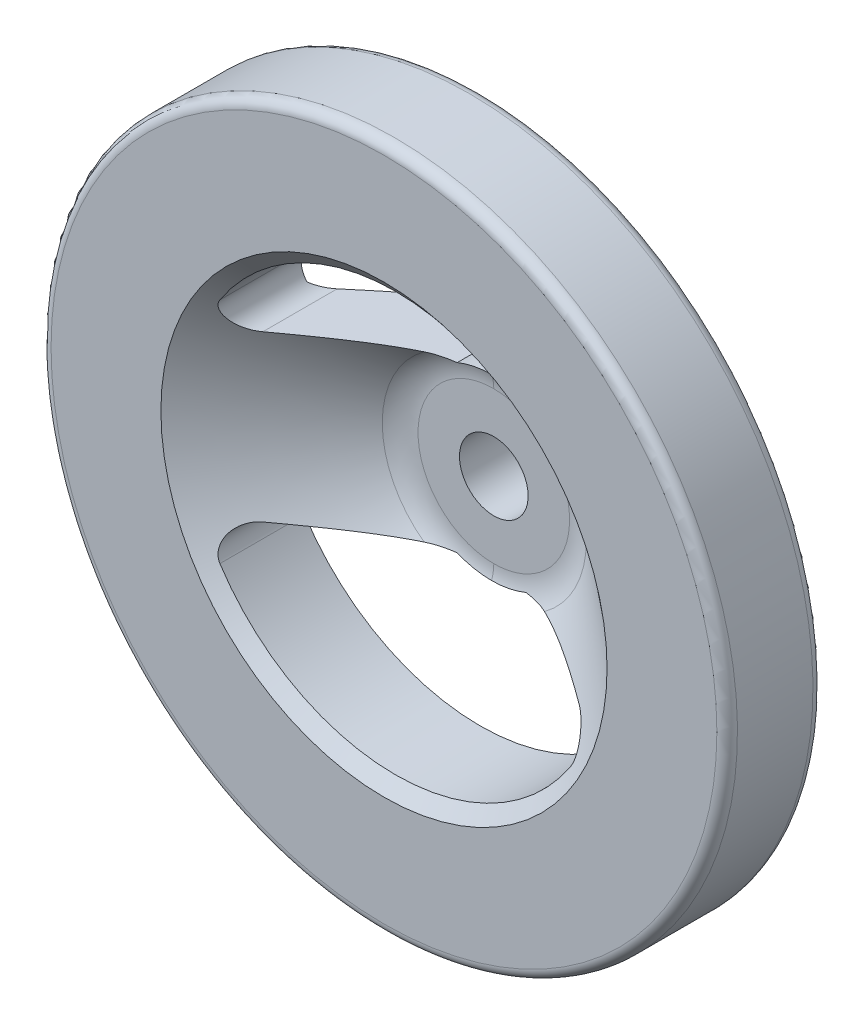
ISO-10303-21;
HEADER;
FILE_DESCRIPTION(('STEP AP214'),'2;1');
FILE_NAME('part.step','',(''),(''),'','','');
FILE_SCHEMA(('AUTOMOTIVE_DESIGN { 1 0 10303 214 1 1 1 1 }'));
ENDSEC;
DATA;
#1=APPLICATION_CONTEXT('core data for automotive mechanical design processes');
#2=APPLICATION_PROTOCOL_DEFINITION('international standard','automotive_design',2000,#1);
#3=PRODUCT_CONTEXT('',#1,'mechanical');
#4=PRODUCT('Part','Part','',(#3));
#5=PRODUCT_RELATED_PRODUCT_CATEGORY('part','',(#4));
#6=PRODUCT_DEFINITION_FORMATION('','',#4);
#7=PRODUCT_DEFINITION_CONTEXT('part definition',#1,'design');
#8=PRODUCT_DEFINITION('design','',#6,#7);
#9=PRODUCT_DEFINITION_SHAPE('','',#8);
#10=(LENGTH_UNIT() NAMED_UNIT(*) SI_UNIT(.MILLI.,.METRE.));
#11=(NAMED_UNIT(*) PLANE_ANGLE_UNIT() SI_UNIT($,.RADIAN.));
#12=(NAMED_UNIT(*) SI_UNIT($,.STERADIAN.) SOLID_ANGLE_UNIT());
#13=UNCERTAINTY_MEASURE_WITH_UNIT(LENGTH_MEASURE(1.E-05),#10,'distance_accuracy_value','');
#14=(GEOMETRIC_REPRESENTATION_CONTEXT(3) GLOBAL_UNCERTAINTY_ASSIGNED_CONTEXT((#13)) GLOBAL_UNIT_ASSIGNED_CONTEXT((#10,
#11,#12)) REPRESENTATION_CONTEXT('',''));
#15=CARTESIAN_POINT('',(0.,0.,0.));
#16=DIRECTION('',(0.,0.,1.));
#17=DIRECTION('',(1.,0.,0.));
#18=AXIS2_PLACEMENT_3D('',#15,#16,#17);
#19=CARTESIAN_POINT('',(0.,0.,0.));
#20=DIRECTION('',(0.,0.,1.));
#21=DIRECTION('',(0.,-1.,0.));
#22=AXIS2_PLACEMENT_3D('',#19,#20,#21);
#23=CYLINDRICAL_SURFACE('',#22,5.);
#24=CARTESIAN_POINT('',(0.,0.,17.));
#25=DIRECTION('',(0.,0.,1.));
#26=DIRECTION('',(0.,-1.,0.));
#27=AXIS2_PLACEMENT_3D('',#24,#25,#26);
#28=CIRCLE('',#27,5.);
#29=CARTESIAN_POINT('',(0.,-5.,17.));
#30=VERTEX_POINT('',#29);
#31=EDGE_CURVE('E617',#30,#30,#28,.T.);
#32=ORIENTED_EDGE('',*,*,#31,.T.);
#33=EDGE_LOOP('',(#32));
#34=FACE_BOUND('',#33,.T.);
#35=CARTESIAN_POINT('',(0.,0.,0.));
#36=DIRECTION('',(0.,0.,1.));
#37=DIRECTION('',(0.,-1.,0.));
#38=AXIS2_PLACEMENT_3D('',#35,#36,#37);
#39=CIRCLE('',#38,5.);
#40=CARTESIAN_POINT('',(0.,-5.,0.));
#41=VERTEX_POINT('',#40);
#42=EDGE_CURVE('E18',#41,#41,#39,.F.);
#43=ORIENTED_EDGE('',*,*,#42,.T.);
#44=EDGE_LOOP('',(#43));
#45=FACE_BOUND('',#44,.T.);
#46=ADVANCED_FACE('F14',(#34,#45),#23,.F.);
#47=CARTESIAN_POINT('',(-13.194524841,13.164845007,0.));
#48=DIRECTION('',(0.,0.,1.));
#49=DIRECTION('',(0.,-1.,0.));
#50=AXIS2_PLACEMENT_3D('',#47,#48,#49);
#51=PLANE('',#50);
#52=ORIENTED_EDGE('',*,*,#42,.F.);
#53=EDGE_LOOP('',(#52));
#54=FACE_BOUND('',#53,.T.);
#55=CARTESIAN_POINT('',(0.,0.,0.));
#56=DIRECTION('',(0.,0.,1.));
#57=DIRECTION('',(0.,-1.,0.));
#58=AXIS2_PLACEMENT_3D('',#55,#56,#57);
#59=CIRCLE('',#58,13.);
#60=CARTESIAN_POINT('',(-5.,-12.,0.));
#61=VERTEX_POINT('',#60);
#62=CARTESIAN_POINT('',(5.00000000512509,-11.9999999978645,0.));
#63=VERTEX_POINT('',#62);
#64=EDGE_CURVE('E614',#61,#63,#59,.T.);
#65=ORIENTED_EDGE('',*,*,#64,.F.);
#66=DIRECTION('',(-1.,0.,0.));
#67=VECTOR('',#66,1.);
#68=CARTESIAN_POINT('',(-14.0244305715,-12.,0.));
#69=LINE('',#68,#67);
#70=CARTESIAN_POINT('',(-5.00102907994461,-11.9999999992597,0.));
#71=VERTEX_POINT('',#70);
#72=EDGE_CURVE('E300',#61,#71,#69,.T.);
#73=ORIENTED_EDGE('',*,*,#72,.T.);
#74=CARTESIAN_POINT('',(0.,0.,0.));
#75=DIRECTION('',(0.,0.,-1.));
#76=DIRECTION('',(0.,1.,0.));
#77=AXIS2_PLACEMENT_3D('',#74,#75,#76);
#78=CIRCLE('',#77,13.000395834);
#79=CARTESIAN_POINT('',(-5.00102907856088,11.9999999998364,0.));
#80=VERTEX_POINT('',#79);
#81=EDGE_CURVE('E492',#80,#71,#78,.F.);
#82=ORIENTED_EDGE('',*,*,#81,.F.);
#83=DIRECTION('',(1.,0.,0.));
#84=VECTOR('',#83,1.);
#85=CARTESIAN_POINT('',(-14.0244305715,12.,0.));
#86=LINE('',#85,#84);
#87=CARTESIAN_POINT('',(-5.,12.,0.));
#88=VERTEX_POINT('',#87);
#89=EDGE_CURVE('E291',#80,#88,#86,.T.);
#90=ORIENTED_EDGE('',*,*,#89,.T.);
#91=CARTESIAN_POINT('',(0.,0.,0.));
#92=DIRECTION('',(0.,0.,1.));
#93=DIRECTION('',(0.,-1.,0.));
#94=AXIS2_PLACEMENT_3D('',#91,#92,#93);
#95=CIRCLE('',#94,13.);
#96=CARTESIAN_POINT('',(5.00000001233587,11.9999999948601,0.));
#97=VERTEX_POINT('',#96);
#98=EDGE_CURVE('E608',#97,#88,#95,.T.);
#99=ORIENTED_EDGE('',*,*,#98,.F.);
#100=DIRECTION('',(-1.,0.,0.));
#101=VECTOR('',#100,1.);
#102=CARTESIAN_POINT('',(0.,11.9999999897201,0.));
#103=LINE('',#102,#101);
#104=CARTESIAN_POINT('',(5.00102908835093,11.9999999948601,0.));
#105=VERTEX_POINT('',#104);
#106=EDGE_CURVE('E603',#105,#97,#103,.T.);
#107=ORIENTED_EDGE('',*,*,#106,.F.);
#108=CARTESIAN_POINT('',(0.,0.,0.));
#109=DIRECTION('',(0.,0.,-1.));
#110=DIRECTION('',(0.,1.,0.));
#111=AXIS2_PLACEMENT_3D('',#108,#109,#110);
#112=CIRCLE('',#111,13.000395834);
#113=CARTESIAN_POINT('',(5.00102908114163,-11.9999999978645,0.));
#114=VERTEX_POINT('',#113);
#115=EDGE_CURVE('E307',#114,#105,#112,.F.);
#116=ORIENTED_EDGE('',*,*,#115,.F.);
#117=DIRECTION('',(1.,0.,0.));
#118=VECTOR('',#117,1.);
#119=CARTESIAN_POINT('',(0.,-11.9999999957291,0.));
#120=LINE('',#119,#118);
#121=EDGE_CURVE('E606',#63,#114,#120,.T.);
#122=ORIENTED_EDGE('',*,*,#121,.F.);
#123=EDGE_LOOP('',(#65,#73,#82,#90,#99,#107,#116,#122));
#124=FACE_BOUND('',#123,.T.);
#125=ADVANCED_FACE('F610',(#54,#124),#51,.F.);
#126=CARTESIAN_POINT('',(0.,0.,31.500069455));
#127=DIRECTION('',(0.,0.,-1.));
#128=DIRECTION('',(0.,1.,0.));
#129=AXIS2_PLACEMENT_3D('',#126,#127,#128);
#130=TOROIDAL_SURFACE('',#129,48.500138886,1.5);
#131=CARTESIAN_POINT('',(0.,0.,31.500069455));
#132=DIRECTION('',(0.,0.,-1.));
#133=DIRECTION('',(0.,1.,0.));
#134=AXIS2_PLACEMENT_3D('',#131,#132,#133);
#135=CIRCLE('',#134,50.000138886);
#136=CARTESIAN_POINT('',(0.,50.000138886,31.500069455));
#137=VERTEX_POINT('',#136);
#138=EDGE_CURVE('E304',#137,#137,#135,.T.);
#139=ORIENTED_EDGE('',*,*,#138,.F.);
#140=EDGE_LOOP('',(#139));
#141=FACE_BOUND('',#140,.T.);
#142=CARTESIAN_POINT('',(0.,0.,33.000069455));
#143=DIRECTION('',(0.,0.,-1.));
#144=DIRECTION('',(0.,1.,0.));
#145=AXIS2_PLACEMENT_3D('',#142,#143,#144);
#146=CIRCLE('',#145,48.5001388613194);
#147=CARTESIAN_POINT('',(0.,48.5001388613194,33.000069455));
#148=VERTEX_POINT('',#147);
#149=EDGE_CURVE('E483',#148,#148,#146,.T.);
#150=ORIENTED_EDGE('',*,*,#149,.T.);
#151=EDGE_LOOP('',(#150));
#152=FACE_BOUND('',#151,.T.);
#153=ADVANCED_FACE('F627',(#141,#152),#130,.T.);
#154=CARTESIAN_POINT('',(-11.208790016,-11.170353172,17.));
#155=DIRECTION('',(0.,0.,-1.));
#156=DIRECTION('',(0.,1.,0.));
#157=AXIS2_PLACEMENT_3D('',#154,#155,#156);
#158=PLANE('',#157);
#159=ORIENTED_EDGE('',*,*,#31,.F.);
#160=EDGE_LOOP('',(#159));
#161=FACE_BOUND('',#160,.T.);
#162=CARTESIAN_POINT('',(0.,-11.0378983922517,17.));
#163=CARTESIAN_POINT('',(-22.0757967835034,-11.0378983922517,17.));
#164=CARTESIAN_POINT('',(-22.0757967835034,11.0378983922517,17.));
#165=CARTESIAN_POINT('',(0.,11.0378983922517,17.));
#166=(BOUNDED_CURVE() B_SPLINE_CURVE(3,(#162,#163,#164,#165),.UNSPECIFIED.,.F.,
.F.) B_SPLINE_CURVE_WITH_KNOTS((4,4),(0.,1.),
.UNSPECIFIED.) CURVE() GEOMETRIC_REPRESENTATION_ITEM() RATIONAL_B_SPLINE_CURVE((0.999999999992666,
0.333333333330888,0.333333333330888,0.999999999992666)) REPRESENTATION_ITEM(''));
#167=CARTESIAN_POINT('',(0.,11.0378983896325,17.));
#168=VERTEX_POINT('',#167);
#169=CARTESIAN_POINT('',(0.,-11.0378983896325,17.));
#170=VERTEX_POINT('',#169);
#171=EDGE_CURVE('E313',#168,#170,#166,.F.);
#172=ORIENTED_EDGE('',*,*,#171,.T.);
#173=CARTESIAN_POINT('',(0.,11.0378983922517,17.));
#174=CARTESIAN_POINT('',(22.0757967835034,11.0378983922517,17.));
#175=CARTESIAN_POINT('',(22.0757967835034,-11.0378983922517,17.));
#176=CARTESIAN_POINT('',(0.,-11.0378983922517,17.));
#177=(BOUNDED_CURVE() B_SPLINE_CURVE(3,(#173,#174,#175,#176),.UNSPECIFIED.,.F.,
.F.) B_SPLINE_CURVE_WITH_KNOTS((4,4),(0.,1.),
.UNSPECIFIED.) CURVE() GEOMETRIC_REPRESENTATION_ITEM() RATIONAL_B_SPLINE_CURVE((0.999999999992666,
0.333333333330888,0.333333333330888,0.999999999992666)) REPRESENTATION_ITEM(''));
#178=EDGE_CURVE('E152',#170,#168,#177,.F.);
#179=ORIENTED_EDGE('',*,*,#178,.T.);
#180=EDGE_LOOP('',(#172,#179));
#181=FACE_BOUND('',#180,.T.);
#182=ADVANCED_FACE('F365',(#161,#181),#158,.F.);
#183=CARTESIAN_POINT('',(0.,0.,0.));
#184=DIRECTION('',(0.,0.,1.));
#185=DIRECTION('',(0.,-1.,0.));
#186=AXIS2_PLACEMENT_3D('',#183,#184,#185);
#187=CYLINDRICAL_SURFACE('',#186,13.);
#188=DIRECTION('',(0.,0.,1.));
#189=VECTOR('',#188,1.);
#190=CARTESIAN_POINT('',(5.,-12.,13.8821988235));
#191=LINE('',#190,#189);
#192=CARTESIAN_POINT('',(4.99999999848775,-12.,17.3298891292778));
#193=VERTEX_POINT('',#192);
#194=EDGE_CURVE('E143',#63,#193,#191,.T.);
#195=ORIENTED_EDGE('',*,*,#194,.T.);
#196=CARTESIAN_POINT('',(0.,0.,17.3298891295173));
#197=DIRECTION('',(0.,0.,-1.));
#198=DIRECTION('',(0.,1.,0.));
#199=AXIS2_PLACEMENT_3D('',#196,#197,#198);
#200=CIRCLE('',#199,12.9999999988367);
#201=CARTESIAN_POINT('',(0.,-12.9999999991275,17.3298891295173));
#202=VERTEX_POINT('',#201);
#203=EDGE_CURVE('E501',#193,#202,#200,.T.);
#204=ORIENTED_EDGE('',*,*,#203,.T.);
#205=CARTESIAN_POINT('',(0.,0.,17.3298891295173));
#206=DIRECTION('',(0.,0.,-1.));
#207=DIRECTION('',(0.,1.,0.));
#208=AXIS2_PLACEMENT_3D('',#205,#206,#207);
#209=CIRCLE('',#208,12.9999999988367);
#210=CARTESIAN_POINT('',(-4.99999999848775,-12.,17.3298891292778));
#211=VERTEX_POINT('',#210);
#212=EDGE_CURVE('E308',#202,#211,#209,.T.);
#213=ORIENTED_EDGE('',*,*,#212,.T.);
#214=DIRECTION('',(0.,0.,-1.));
#215=VECTOR('',#214,1.);
#216=CARTESIAN_POINT('',(-5.,-12.,13.8821988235));
#217=LINE('',#216,#215);
#218=EDGE_CURVE('E303',#211,#61,#217,.T.);
#219=ORIENTED_EDGE('',*,*,#218,.T.);
#220=ORIENTED_EDGE('',*,*,#64,.T.);
#221=EDGE_LOOP('',(#195,#204,#213,#219,#220));
#222=FACE_BOUND('',#221,.T.);
#223=ADVANCED_FACE('F575',(#222),#187,.T.);
#224=CARTESIAN_POINT('',(0.,0.,0.));
#225=DIRECTION('',(0.,0.,1.));
#226=DIRECTION('',(0.,-1.,0.));
#227=AXIS2_PLACEMENT_3D('',#224,#225,#226);
#228=CYLINDRICAL_SURFACE('',#227,13.);
#229=CARTESIAN_POINT('',(0.,0.,17.3298891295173));
#230=DIRECTION('',(0.,0.,-1.));
#231=DIRECTION('',(0.,1.,0.));
#232=AXIS2_PLACEMENT_3D('',#229,#230,#231);
#233=CIRCLE('',#232,12.9999999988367);
#234=CARTESIAN_POINT('',(-5.00000000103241,12.,17.3298891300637));
#235=VERTEX_POINT('',#234);
#236=CARTESIAN_POINT('',(0.,12.9999999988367,17.3298891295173));
#237=VERTEX_POINT('',#236);
#238=EDGE_CURVE('E613',#235,#237,#233,.T.);
#239=ORIENTED_EDGE('',*,*,#238,.T.);
#240=CARTESIAN_POINT('',(0.,0.,17.3298891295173));
#241=DIRECTION('',(0.,0.,-1.));
#242=DIRECTION('',(0.,1.,0.));
#243=AXIS2_PLACEMENT_3D('',#240,#241,#242);
#244=CIRCLE('',#243,12.9999999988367);
#245=CARTESIAN_POINT('',(4.99999999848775,12.,17.3298891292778));
#246=VERTEX_POINT('',#245);
#247=EDGE_CURVE('E510',#237,#246,#244,.T.);
#248=ORIENTED_EDGE('',*,*,#247,.T.);
#249=DIRECTION('',(0.,0.,-1.));
#250=VECTOR('',#249,1.);
#251=CARTESIAN_POINT('',(5.,12.,13.8821988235));
#252=LINE('',#251,#250);
#253=EDGE_CURVE('E253',#246,#97,#252,.T.);
#254=ORIENTED_EDGE('',*,*,#253,.T.);
#255=ORIENTED_EDGE('',*,*,#98,.T.);
#256=DIRECTION('',(0.,0.,1.));
#257=VECTOR('',#256,1.);
#258=CARTESIAN_POINT('',(-5.,12.,13.8821988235));
#259=LINE('',#258,#257);
#260=EDGE_CURVE('E299',#88,#235,#259,.T.);
#261=ORIENTED_EDGE('',*,*,#260,.T.);
#262=EDGE_LOOP('',(#239,#248,#254,#255,#261));
#263=FACE_BOUND('',#262,.T.);
#264=ADVANCED_FACE('F332',(#263),#228,.T.);
#265=CARTESIAN_POINT('',(0.,-11.037898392,17.));
#266=CARTESIAN_POINT('',(-22.075796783,-11.037898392,17.));
#267=CARTESIAN_POINT('',(-22.075796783,11.037898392,17.));
#268=CARTESIAN_POINT('',(0.,11.037898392,17.));
#269=CARTESIAN_POINT('',(0.,-12.450713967,17.));
#270=CARTESIAN_POINT('',(-24.901427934,-12.450713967,17.));
#271=CARTESIAN_POINT('',(-24.901427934,12.450713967,17.));
#272=CARTESIAN_POINT('',(0.,12.450713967,17.));
#273=CARTESIAN_POINT('',(0.,-13.779749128,17.47928425));
#274=CARTESIAN_POINT('',(-27.559498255,-13.779749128,17.47928425));
#275=CARTESIAN_POINT('',(-27.559498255,13.779749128,17.47928425));
#276=CARTESIAN_POINT('',(0.,13.779749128,17.47928425));
#277=CARTESIAN_POINT('',(0.,-14.867379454,18.381009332));
#278=CARTESIAN_POINT('',(-29.734758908,-14.867379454,18.381009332));
#279=CARTESIAN_POINT('',(-29.734758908,14.867379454,18.381009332));
#280=CARTESIAN_POINT('',(0.,14.867379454,18.381009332));
#281=(BOUNDED_SURFACE() B_SPLINE_SURFACE(3,3,((#265,#266,#267,#268),(#269,#270,#271,#272),(#273,
#274,#275,#276),(#277,#278,#279,#280)),.UNSPECIFIED.,.F.,.F.,
.F.) B_SPLINE_SURFACE_WITH_KNOTS((4,4),(4,4),(0.,1.),(0.,1.),
.UNSPECIFIED.) GEOMETRIC_REPRESENTATION_ITEM() RATIONAL_B_SPLINE_SURFACE(((1.,0.333333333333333,
0.333333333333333,1.),(0.96046645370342,0.320155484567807,0.320155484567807,0.96046645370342),
(0.96046645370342,0.320155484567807,0.320155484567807,0.96046645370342),(1.,0.333333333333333,
0.333333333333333,1.))) REPRESENTATION_ITEM('') SURFACE());
#282=CARTESIAN_POINT('',(0.,-11.037898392,17.));
#283=CARTESIAN_POINT('',(0.,-12.450713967,17.));
#284=CARTESIAN_POINT('',(0.,-13.779749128,17.47928425));
#285=CARTESIAN_POINT('',(0.,-14.867379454,18.381009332));
#286=(BOUNDED_CURVE() B_SPLINE_CURVE(3,(#282,#283,#284,#285),.UNSPECIFIED.,.F.,
.F.) B_SPLINE_CURVE_WITH_KNOTS((4,4),(0.,1.),
.UNSPECIFIED.) CURVE() GEOMETRIC_REPRESENTATION_ITEM() RATIONAL_B_SPLINE_CURVE((1.,
0.96046645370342,0.96046645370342,1.)) REPRESENTATION_ITEM(''));
#287=EDGE_CURVE('E254',#202,#170,#286,.F.);
#288=CARTESIAN_POINT('',(0.,11.037898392,17.));
#289=CARTESIAN_POINT('',(0.,12.450713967,17.));
#290=CARTESIAN_POINT('',(0.,13.779749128,17.47928425));
#291=CARTESIAN_POINT('',(0.,14.867379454,18.381009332));
#292=(BOUNDED_CURVE() B_SPLINE_CURVE(3,(#288,#289,#290,#291),.UNSPECIFIED.,.F.,
.F.) B_SPLINE_CURVE_WITH_KNOTS((4,4),(0.,1.),
.UNSPECIFIED.) CURVE() GEOMETRIC_REPRESENTATION_ITEM() RATIONAL_B_SPLINE_CURVE((1.,
0.96046645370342,0.96046645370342,1.)) REPRESENTATION_ITEM(''));
#293=EDGE_CURVE('E506',#168,#237,#292,.T.);
#294=CARTESIAN_POINT('',(-5.00000000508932,12.,17.3298891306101));
#295=CARTESIAN_POINT('',(-5.10747465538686,12.,17.3441946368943));
#296=CARTESIAN_POINT('',(-5.21483727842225,12.,17.3593818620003));
#297=CARTESIAN_POINT('',(-5.42930255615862,12.,17.391680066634));
#298=CARTESIAN_POINT('',(-5.53640513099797,12.,17.4087915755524));
#299=CARTESIAN_POINT('',(-5.75026237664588,12.,17.4450921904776));
#300=CARTESIAN_POINT('',(-5.85701702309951,12.,17.4642814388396));
#301=CARTESIAN_POINT('',(-6.28113015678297,12.,17.5451178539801));
#302=CARTESIAN_POINT('',(-6.59687892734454,12.,17.6155888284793));
#303=CARTESIAN_POINT('',(-7.22940253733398,12.,17.782830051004));
#304=CARTESIAN_POINT('',(-7.54603125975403,12.,17.8801724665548));
#305=CARTESIAN_POINT('',(-7.96147603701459,12.,18.0304042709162));
#306=CARTESIAN_POINT('',(-8.06522140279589,12.,18.0698515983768));
#307=CARTESIAN_POINT('',(-8.27129835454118,12.,18.1523530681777));
#308=CARTESIAN_POINT('',(-8.3736296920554,12.,18.1954078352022));
#309=CARTESIAN_POINT('',(-8.57668862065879,12.,18.2853186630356));
#310=CARTESIAN_POINT('',(-8.67741509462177,12.,18.3321772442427));
#311=CARTESIAN_POINT('',(-8.7771847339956,12.,18.38100933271));
#312=B_SPLINE_CURVE_WITH_KNOTS('',3,(#294,#295,#296,#297,#298,#299,#300,#301,#302,#303,#304,
#305,#306,#307,#308,#309,#310,#311),.UNSPECIFIED.,.F.,.F.,(4,2,2,2,2,2,2,2,4),(0.,
0.325272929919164,0.65063556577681,0.976020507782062,1.94579706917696,2.93807053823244,
3.27099515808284,3.60397754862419,3.93718240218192),.UNSPECIFIED.);
#313=CARTESIAN_POINT('',(-8.77718473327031,12.,18.381009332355));
#314=VERTEX_POINT('',#313);
#315=EDGE_CURVE('E342',#235,#314,#312,.T.);
#316=CARTESIAN_POINT('',(0.,0.,18.381009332));
#317=DIRECTION('',(0.,0.,1.));
#318=DIRECTION('',(0.,-1.,0.));
#319=AXIS2_PLACEMENT_3D('',#316,#317,#318);
#320=CIRCLE('',#319,14.867379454);
#321=CARTESIAN_POINT('',(-8.77718473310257,-12.,18.3810093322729));
#322=VERTEX_POINT('',#321);
#323=EDGE_CURVE('E497',#314,#322,#320,.T.);
#324=CARTESIAN_POINT('',(-8.77718473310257,-12.,18.3810093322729));
#325=CARTESIAN_POINT('',(-8.67999373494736,-12.,18.3334392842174));
#326=CARTESIAN_POINT('',(-8.58189430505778,-12.,18.2877419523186));
#327=CARTESIAN_POINT('',(-8.38416295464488,-12.,18.1999625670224));
#328=CARTESIAN_POINT('',(-8.28453203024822,-12.,18.1578782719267));
#329=CARTESIAN_POINT('',(-8.08391640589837,-12.,18.0771423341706));
#330=CARTESIAN_POINT('',(-7.9829319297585,-12.,18.0384901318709));
#331=CARTESIAN_POINT('',(-7.57854022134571,-12.,17.8910917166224));
#332=CARTESIAN_POINT('',(-7.27039900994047,-12.,17.7951601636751));
#333=CARTESIAN_POINT('',(-6.63858554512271,-12.,17.6253033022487));
#334=CARTESIAN_POINT('',(-6.31472300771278,-12.,17.5521077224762));
#335=CARTESIAN_POINT('',(-5.87959281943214,-12.,17.4684170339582));
#336=CARTESIAN_POINT('',(-5.7700371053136,-12.,17.4485739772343));
#337=CARTESIAN_POINT('',(-5.55055638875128,-12.,17.4110863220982));
#338=CARTESIAN_POINT('',(-5.4406314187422,-12.,17.3934415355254));
#339=CARTESIAN_POINT('',(-5.22051007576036,-12.,17.360185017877));
#340=CARTESIAN_POINT('',(-5.11031380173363,-12.,17.3445726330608));
#341=CARTESIAN_POINT('',(-5.00000000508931,-12.,17.3298891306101));
#342=B_SPLINE_CURVE_WITH_KNOTS('',3,(#324,#325,#326,#327,#328,#329,#330,#331,#332,#333,#334,
#335,#336,#337,#338,#339,#340,#341),.UNSPECIFIED.,.F.,.F.,(4,2,2,2,2,2,2,2,4),(0.,
0.324594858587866,0.648986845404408,0.973325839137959,1.94012452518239,2.93534099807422,
3.26934389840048,3.60331819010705,3.93718478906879),.UNSPECIFIED.);
#343=EDGE_CURVE('E349',#322,#211,#342,.T.);
#344=ORIENTED_EDGE('',*,*,#287,.T.);
#345=ORIENTED_EDGE('',*,*,#171,.F.);
#346=ORIENTED_EDGE('',*,*,#293,.T.);
#347=ORIENTED_EDGE('',*,*,#238,.F.);
#348=ORIENTED_EDGE('',*,*,#315,.T.);
#349=ORIENTED_EDGE('',*,*,#323,.T.);
#350=ORIENTED_EDGE('',*,*,#343,.T.);
#351=ORIENTED_EDGE('',*,*,#212,.F.);
#352=EDGE_LOOP('',(#344,#345,#346,#347,#348,#349,#350,#351));
#353=FACE_BOUND('',#352,.T.);
#354=ADVANCED_FACE('F319',(#353),#281,.F.);
#355=CARTESIAN_POINT('',(0.,0.,31.500069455));
#356=DIRECTION('',(0.,0.,-1.));
#357=DIRECTION('',(0.,1.,0.));
#358=AXIS2_PLACEMENT_3D('',#355,#356,#357);
#359=CYLINDRICAL_SURFACE('',#358,50.000138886);
#360=CARTESIAN_POINT('',(0.,0.,20.500180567));
#361=DIRECTION('',(0.,0.,-1.));
#362=DIRECTION('',(0.,1.,0.));
#363=AXIS2_PLACEMENT_3D('',#360,#361,#362);
#364=CIRCLE('',#363,50.000138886);
#365=CARTESIAN_POINT('',(0.,50.000138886,20.500180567));
#366=VERTEX_POINT('',#365);
#367=EDGE_CURVE('E489',#366,#366,#364,.T.);
#368=ORIENTED_EDGE('',*,*,#367,.F.);
#369=EDGE_LOOP('',(#368));
#370=FACE_BOUND('',#369,.T.);
#371=ORIENTED_EDGE('',*,*,#138,.T.);
#372=EDGE_LOOP('',(#371));
#373=FACE_BOUND('',#372,.T.);
#374=ADVANCED_FACE('F331',(#370,#373),#359,.T.);
#375=CARTESIAN_POINT('',(0.,0.,4.348006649));
#376=DIRECTION('',(0.,0.,-1.));
#377=DIRECTION('',(0.,1.,0.));
#378=AXIS2_PLACEMENT_3D('',#375,#376,#377);
#379=CYLINDRICAL_SURFACE('',#378,13.000395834);
#380=ORIENTED_EDGE('',*,*,#115,.T.);
#381=DIRECTION('',(0.,0.,1.));
#382=VECTOR('',#381,1.);
#383=CARTESIAN_POINT('',(5.00102907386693,12.,13.8821988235));
#384=LINE('',#383,#382);
#385=CARTESIAN_POINT('',(5.0010290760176,12.,4.34800664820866));
#386=VERTEX_POINT('',#385);
#387=EDGE_CURVE('E534',#105,#386,#384,.T.);
#388=ORIENTED_EDGE('',*,*,#387,.T.);
#389=CARTESIAN_POINT('',(0.,0.,4.34800664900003));
#390=DIRECTION('',(0.,0.,1.));
#391=DIRECTION('',(0.,-1.,0.));
#392=AXIS2_PLACEMENT_3D('',#389,#390,#391);
#393=CIRCLE('',#392,13.000395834);
#394=CARTESIAN_POINT('',(5.00102907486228,-12.,4.34800664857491));
#395=VERTEX_POINT('',#394);
#396=EDGE_CURVE('E493',#395,#386,#393,.T.);
#397=ORIENTED_EDGE('',*,*,#396,.F.);
#398=DIRECTION('',(0.,0.,-1.));
#399=VECTOR('',#398,1.);
#400=CARTESIAN_POINT('',(5.00102907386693,-12.,13.8821988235));
#401=LINE('',#400,#399);
#402=EDGE_CURVE('E520',#395,#114,#401,.T.);
#403=ORIENTED_EDGE('',*,*,#402,.T.);
#404=EDGE_LOOP('',(#380,#388,#397,#403));
#405=FACE_BOUND('',#404,.T.);
#406=ADVANCED_FACE('F363',(#405),#379,.T.);
#407=CARTESIAN_POINT('',(-23.048861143,-12.,0.));
#408=DIRECTION('',(0.,1.,0.));
#409=DIRECTION('',(0.,0.,1.));
#410=AXIS2_PLACEMENT_3D('',#407,#408,#409);
#411=PLANE('',#410);
#412=ORIENTED_EDGE('',*,*,#72,.F.);
#413=ORIENTED_EDGE('',*,*,#218,.F.);
#414=ORIENTED_EDGE('',*,*,#343,.F.);
#415=CARTESIAN_POINT('',(-8.77718473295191,-11.9999999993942,18.3810093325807));
#416=CARTESIAN_POINT('',(-9.0961743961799,-11.9999999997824,18.5371845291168));
#417=CARTESIAN_POINT('',(-9.41297761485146,-11.9999999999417,18.6977474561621));
#418=CARTESIAN_POINT('',(-10.0425774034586,-12.0000000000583,19.0264320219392));
#419=CARTESIAN_POINT('',(-10.3553746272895,-12.0000000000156,19.1945524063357));
#420=CARTESIAN_POINT('',(-10.9772340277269,-11.9999999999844,19.53707749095));
#421=CARTESIAN_POINT('',(-11.2862984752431,-11.9999999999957,19.7114780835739));
#422=CARTESIAN_POINT('',(-11.9012868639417,-12.0000000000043,20.0657531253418));
#423=CARTESIAN_POINT('',(-12.2072106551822,-12.0000000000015,20.245627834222));
#424=CARTESIAN_POINT('',(-13.1197436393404,-11.999999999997,20.7916255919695));
#425=CARTESIAN_POINT('',(-13.7221844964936,-11.9999999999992,21.1647188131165));
#426=CARTESIAN_POINT('',(-14.9183188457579,-12.0000000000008,21.9248277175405));
#427=CARTESIAN_POINT('',(-15.5120106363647,-12.0000000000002,22.3118460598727));
#428=CARTESIAN_POINT('',(-16.6914732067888,-11.9999999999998,23.0959244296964));
#429=CARTESIAN_POINT('',(-17.2772541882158,-11.9999999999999,23.4929691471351));
#430=CARTESIAN_POINT('',(-18.443144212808,-12.0000000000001,24.295302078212));
#431=CARTESIAN_POINT('',(-19.0232531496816,-12.,24.7005904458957));
#432=CARTESIAN_POINT('',(-20.1797893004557,-12.,25.5183626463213));
#433=CARTESIAN_POINT('',(-20.7562089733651,-12.,25.9308571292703));
#434=CARTESIAN_POINT('',(-21.6179761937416,-12.,26.5535552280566));
#435=CARTESIAN_POINT('',(-21.9047560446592,-12.,26.7617815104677));
#436=CARTESIAN_POINT('',(-22.4774423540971,-12.,27.1794280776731));
#437=CARTESIAN_POINT('',(-22.7633488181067,-12.,27.3888483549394));
#438=CARTESIAN_POINT('',(-23.0488611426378,-12.,27.5988048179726));
#439=B_SPLINE_CURVE_WITH_KNOTS('',3,(#415,#416,#417,#418,#419,#420,#421,#422,#423,#424,#425,
#426,#427,#428,#429,#430,#431,#432,#433,#434,#435,#436,#437,#438),.UNSPECIFIED.,.F.,.F.,(4,2,2,
2,2,2,2,2,2,2,2,4),(0.,1.06542364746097,2.13067111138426,3.19523406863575,4.25984761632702,
6.3854011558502,8.51136275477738,10.634253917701,12.7571847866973,14.8835754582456,
15.9467794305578,17.0099767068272),.UNSPECIFIED.);
#440=CARTESIAN_POINT('',(-23.0488611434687,-12.,27.5988048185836));
#441=VERTEX_POINT('',#440);
#442=EDGE_CURVE('E371',#322,#441,#439,.T.);
#443=ORIENTED_EDGE('',*,*,#442,.T.);
#444=DIRECTION('',(0.,0.,-1.));
#445=VECTOR('',#444,1.);
#446=CARTESIAN_POINT('',(-23.0488611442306,-12.,24.0551029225));
#447=LINE('',#446,#445);
#448=CARTESIAN_POINT('',(-23.0488611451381,-12.,16.7686108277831));
#449=VERTEX_POINT('',#448);
#450=EDGE_CURVE('E387',#441,#449,#447,.T.);
#451=ORIENTED_EDGE('',*,*,#450,.T.);
#452=CARTESIAN_POINT('',(-5.0010290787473,-12.,4.34800664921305));
#453=CARTESIAN_POINT('',(-5.21482366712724,-12.,4.42667998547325));
#454=CARTESIAN_POINT('',(-5.42719738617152,-12.,4.50911563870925));
#455=CARTESIAN_POINT('',(-5.84914360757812,-12.,4.68074470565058));
#456=CARTESIAN_POINT('',(-6.05871674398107,-12.,4.7699365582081));
#457=CARTESIAN_POINT('',(-6.68295021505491,-12.,5.04633576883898));
#458=CARTESIAN_POINT('',(-7.09362972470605,-12.,5.24255636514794));
#459=CARTESIAN_POINT('',(-7.90378334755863,-12.,5.6532471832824));
#460=CARTESIAN_POINT('',(-8.30329248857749,-12.,5.86764913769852));
#461=CARTESIAN_POINT('',(-9.09397832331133,-12.,6.31153123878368));
#462=CARTESIAN_POINT('',(-9.48515220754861,-12.,6.54101636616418));
#463=CARTESIAN_POINT('',(-10.257831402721,-12.,7.010584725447));
#464=CARTESIAN_POINT('',(-10.6393807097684,-12.,7.25059592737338));
#465=CARTESIAN_POINT('',(-11.396263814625,-12.,7.74023528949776));
#466=CARTESIAN_POINT('',(-11.7715973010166,-12.,7.98986392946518));
#467=CARTESIAN_POINT('',(-12.5172809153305,-12.,8.49722226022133));
#468=CARTESIAN_POINT('',(-12.8876257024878,-12.,8.75495977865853));
#469=CARTESIAN_POINT('',(-13.6237130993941,-12.,9.27693124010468));
#470=CARTESIAN_POINT('',(-13.9894555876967,-12.,9.54116535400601));
#471=CARTESIAN_POINT('',(-14.7264926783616,-12.,10.0820323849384));
#472=CARTESIAN_POINT('',(-15.0976818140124,-12.,10.3588087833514));
#473=CARTESIAN_POINT('',(-15.8364574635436,-12.,10.9171326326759));
#474=CARTESIAN_POINT('',(-16.2040439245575,-12.,11.1986801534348));
#475=CARTESIAN_POINT('',(-16.9359294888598,-12.,11.7656763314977));
#476=CARTESIAN_POINT('',(-17.3002299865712,-12.,12.0511231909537));
#477=CARTESIAN_POINT('',(-18.0261177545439,-12.,12.6254470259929));
#478=CARTESIAN_POINT('',(-18.3877050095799,-12.,12.9143240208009));
#479=CARTESIAN_POINT('',(-19.1105363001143,-12.,13.4966567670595));
#480=CARTESIAN_POINT('',(-19.4717669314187,-12.,13.7901291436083));
#481=CARTESIAN_POINT('',(-20.1921227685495,-12.,14.3796469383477));
#482=CARTESIAN_POINT('',(-20.5512479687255,-12.,14.6756923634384));
#483=CARTESIAN_POINT('',(-21.2677357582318,-12.,15.2700944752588));
#484=CARTESIAN_POINT('',(-21.62509786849,-12.,15.5684517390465));
#485=CARTESIAN_POINT('',(-22.3381675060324,-12.,16.1671271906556));
#486=CARTESIAN_POINT('',(-22.6938750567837,-12.,16.4674453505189));
#487=CARTESIAN_POINT('',(-23.0488611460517,-12.,16.7686108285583));
#488=B_SPLINE_CURVE_WITH_KNOTS('',3,(#452,#453,#454,#455,#456,#457,#458,#459,#460,#461,#462,
#463,#464,#465,#466,#467,#468,#469,#470,#471,#472,#473,#474,#475,#476,#477,#478,#479,#480,#481,
#482,#483,#484,#485,#486,#487),.UNSPECIFIED.,.F.,.F.,(4,2,2,2,2,2,2,2,2,2,2,2,2,2,2,2,2,4),(0.,
0.683341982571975,1.36652654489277,2.73127982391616,4.09111820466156,5.45140790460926,
6.80351754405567,8.15569472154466,9.5092198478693,10.8627806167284,12.2517919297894,
13.6408235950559,15.0292351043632,16.4176543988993,17.8138938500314,19.210137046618,
20.6067407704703,22.0033246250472),.UNSPECIFIED.);
#489=CARTESIAN_POINT('',(-5.00102907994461,-11.9999999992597,4.34800664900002));
#490=VERTEX_POINT('',#489);
#491=EDGE_CURVE('E378',#490,#449,#488,.T.);
#492=ORIENTED_EDGE('',*,*,#491,.F.);
#493=DIRECTION('',(0.,0.,1.));
#494=VECTOR('',#493,1.);
#495=CARTESIAN_POINT('',(-5.00102908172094,-11.9999999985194,2.1740033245));
#496=LINE('',#495,#494);
#497=EDGE_CURVE('E484',#71,#490,#496,.T.);
#498=ORIENTED_EDGE('',*,*,#497,.F.);
#499=EDGE_LOOP('',(#412,#413,#414,#443,#451,#492,#498));
#500=FACE_BOUND('',#499,.T.);
#501=ADVANCED_FACE('F358',(#500),#411,.F.);
#502=CARTESIAN_POINT('',(-23.048861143,12.,27.764397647));
#503=DIRECTION('',(0.,-1.,0.));
#504=DIRECTION('',(0.,0.,-1.));
#505=AXIS2_PLACEMENT_3D('',#502,#503,#504);
#506=PLANE('',#505);
#507=CARTESIAN_POINT('',(-23.0488611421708,11.9999999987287,27.5988048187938));
#508=CARTESIAN_POINT('',(-22.7633488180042,11.9999999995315,27.3888483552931));
#509=CARTESIAN_POINT('',(-22.4774423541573,11.9999999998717,27.1794280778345));
#510=CARTESIAN_POINT('',(-21.9047560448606,12.0000000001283,26.7617815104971));
#511=CARTESIAN_POINT('',(-21.6179761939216,12.0000000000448,26.5535552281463));
#512=CARTESIAN_POINT('',(-20.7562089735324,11.9999999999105,25.9308571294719));
#513=CARTESIAN_POINT('',(-20.1797893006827,11.999999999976,25.518362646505));
#514=CARTESIAN_POINT('',(-19.0232531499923,12.0000000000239,24.7005904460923));
#515=CARTESIAN_POINT('',(-18.4431442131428,12.0000000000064,24.2953020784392));
#516=CARTESIAN_POINT('',(-17.2772541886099,11.9999999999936,23.4929691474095));
#517=CARTESIAN_POINT('',(-16.6914732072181,11.9999999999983,23.0959244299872));
#518=CARTESIAN_POINT('',(-15.5120106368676,12.0000000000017,22.3118460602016));
#519=CARTESIAN_POINT('',(-14.9183188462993,12.0000000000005,21.924827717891));
#520=CARTESIAN_POINT('',(-13.7221844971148,11.9999999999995,21.1647188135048));
#521=CARTESIAN_POINT('',(-13.119743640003,11.9999999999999,20.7916255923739));
#522=CARTESIAN_POINT('',(-12.2072106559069,12.,20.2456278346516));
#523=CARTESIAN_POINT('',(-11.9012868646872,12.,20.0657531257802));
#524=CARTESIAN_POINT('',(-11.2862984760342,12.,19.7114780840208));
#525=CARTESIAN_POINT('',(-10.9772340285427,12.,19.5370774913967));
#526=CARTESIAN_POINT('',(-10.3553746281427,12.,19.1945524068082));
#527=CARTESIAN_POINT('',(-10.0425774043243,12.,19.0264320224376));
#528=CARTESIAN_POINT('',(-9.41297761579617,12.,18.6977474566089));
#529=CARTESIAN_POINT('',(-9.09617439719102,12.,18.537184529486));
#530=CARTESIAN_POINT('',(-8.77718473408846,12.,18.3810093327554));
#531=B_SPLINE_CURVE_WITH_KNOTS('',3,(#507,#508,#509,#510,#511,#512,#513,#514,#515,#516,#517,
#518,#519,#520,#521,#522,#523,#524,#525,#526,#527,#528,#529,#530),.UNSPECIFIED.,.F.,.F.,(4,2,2,
2,2,2,2,2,2,2,2,4),(0.,1.06319727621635,2.12640124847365,4.25279191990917,6.37572278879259,
8.49861395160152,10.6245755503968,12.7501290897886,13.8147426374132,14.8793055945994,
15.9445530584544,17.0099767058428),.UNSPECIFIED.);
#532=CARTESIAN_POINT('',(-23.0488611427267,12.,27.598804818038));
#533=VERTEX_POINT('',#532);
#534=EDGE_CURVE('E255',#533,#314,#531,.T.);
#535=ORIENTED_EDGE('',*,*,#534,.T.);
#536=ORIENTED_EDGE('',*,*,#315,.F.);
#537=ORIENTED_EDGE('',*,*,#260,.F.);
#538=ORIENTED_EDGE('',*,*,#89,.F.);
#539=DIRECTION('',(0.,0.,-1.));
#540=VECTOR('',#539,1.);
#541=CARTESIAN_POINT('',(-5.0010290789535,11.9999999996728,2.1740033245));
#542=LINE('',#541,#540);
#543=CARTESIAN_POINT('',(-5.0010290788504,11.9999999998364,4.34800664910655));
#544=VERTEX_POINT('',#543);
#545=EDGE_CURVE('E480',#544,#80,#542,.T.);
#546=ORIENTED_EDGE('',*,*,#545,.F.);
#547=CARTESIAN_POINT('',(-23.0488611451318,11.9999999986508,16.7686108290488));
#548=CARTESIAN_POINT('',(-22.6994914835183,11.9999999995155,16.4722096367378));
#549=CARTESIAN_POINT('',(-22.3494226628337,11.9999999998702,16.1766296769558));
#550=CARTESIAN_POINT('',(-21.6476858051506,12.0000000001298,15.5873652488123));
#551=CARTESIAN_POINT('',(-21.2960177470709,12.0000000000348,15.2936808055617));
#552=CARTESIAN_POINT('',(-20.5909913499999,11.9999999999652,14.7085517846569));
#553=CARTESIAN_POINT('',(-20.2376335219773,11.9999999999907,14.4171065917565));
#554=CARTESIAN_POINT('',(-19.5288908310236,12.0000000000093,13.8366916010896));
#555=CARTESIAN_POINT('',(-19.1735059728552,12.0000000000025,13.547721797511));
#556=CARTESIAN_POINT('',(-18.4623667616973,11.9999999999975,12.974199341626));
#557=CARTESIAN_POINT('',(-18.1066248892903,11.9999999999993,12.689631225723));
#558=CARTESIAN_POINT('',(-17.3925404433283,12.0000000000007,12.1237777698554));
#559=CARTESIAN_POINT('',(-17.0341978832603,12.0000000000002,11.8424924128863));
#560=CARTESIAN_POINT('',(-16.3143644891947,11.9999999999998,11.2836330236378));
#561=CARTESIAN_POINT('',(-15.9528722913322,12.,11.0060607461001));
#562=CARTESIAN_POINT('',(-15.2264525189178,12.,10.4554520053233));
#563=CARTESIAN_POINT('',(-14.8615249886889,12.,10.1824154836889));
#564=CARTESIAN_POINT('',(-14.1255046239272,12.,9.64012398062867));
#565=CARTESIAN_POINT('',(-13.7543880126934,12.,9.37090121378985));
#566=CARTESIAN_POINT('',(-13.0074833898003,12.,8.83902229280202));
#567=CARTESIAN_POINT('',(-12.6316955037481,12.,8.5763659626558));
#568=CARTESIAN_POINT('',(-11.8750436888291,12.,8.05927912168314));
#569=CARTESIAN_POINT('',(-11.4941852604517,12.,7.80484058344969));
#570=CARTESIAN_POINT('',(-10.726127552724,12.,7.30572565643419));
#571=CARTESIAN_POINT('',(-10.338928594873,12.,7.06104877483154));
#572=CARTESIAN_POINT('',(-9.55474676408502,12.,6.58233085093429));
#573=CARTESIAN_POINT('',(-9.15771870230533,12.,6.34836356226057));
#574=CARTESIAN_POINT('',(-8.35508520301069,12.,5.89581673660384));
#575=CARTESIAN_POINT('',(-7.94948275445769,12.,5.67723194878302));
#576=CARTESIAN_POINT('',(-7.33291676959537,12.,5.36350414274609));
#577=CARTESIAN_POINT('',(-7.12563510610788,12.,5.26110649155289));
#578=CARTESIAN_POINT('',(-6.70844806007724,12.,5.06182244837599));
#579=CARTESIAN_POINT('',(-6.49854285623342,12.,4.96493568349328));
#580=CARTESIAN_POINT('',(-6.07572829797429,12.,4.7772398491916));
#581=CARTESIAN_POINT('',(-5.86281571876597,12.,4.6864380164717));
#582=CARTESIAN_POINT('',(-5.43409867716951,12.,4.51179699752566));
#583=CARTESIAN_POINT('',(-5.21829353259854,12.,4.42795948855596));
#584=CARTESIAN_POINT('',(-5.00102907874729,12.,4.34800664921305));
#585=B_SPLINE_CURVE_WITH_KNOTS('',3,(#547,#548,#549,#550,#551,#552,#553,#554,#555,#556,#557,
#558,#559,#560,#561,#562,#563,#564,#565,#566,#567,#568,#569,#570,#571,#572,#573,#574,#575,#576,
#577,#578,#579,#580,#581,#582,#583,#584),.UNSPECIFIED.,.F.,.F.,(4,2,2,2,2,2,2,2,2,2,2,2,2,2,2,2,
2,2,4),(0.,1.37448882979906,2.7489958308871,4.12311060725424,5.49722215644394,6.86387366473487,
8.23051809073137,9.59778704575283,10.9650383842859,12.3404342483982,13.7157932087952,
15.0897653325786,16.463668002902,17.8459283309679,19.2277145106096,19.9212324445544,
20.6147033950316,21.3089849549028,22.003433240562),.UNSPECIFIED.);
#586=CARTESIAN_POINT('',(-23.0488611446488,12.,16.768610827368));
#587=VERTEX_POINT('',#586);
#588=EDGE_CURVE('E411',#587,#544,#585,.T.);
#589=ORIENTED_EDGE('',*,*,#588,.F.);
#590=DIRECTION('',(0.,0.,1.));
#591=VECTOR('',#590,1.);
#592=CARTESIAN_POINT('',(-23.0488611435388,12.,24.0551029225));
#593=LINE('',#592,#591);
#594=EDGE_CURVE('E486',#587,#533,#593,.T.);
#595=ORIENTED_EDGE('',*,*,#594,.T.);
#596=EDGE_LOOP('',(#535,#536,#537,#538,#546,#589,#595));
#597=FACE_BOUND('',#596,.T.);
#598=ADVANCED_FACE('F362',(#597),#506,.F.);
#599=CARTESIAN_POINT('',(0.,0.,4.348006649));
#600=DIRECTION('',(0.,0.,-1.));
#601=DIRECTION('',(0.,1.,0.));
#602=AXIS2_PLACEMENT_3D('',#599,#600,#601);
#603=CYLINDRICAL_SURFACE('',#602,13.000395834);
#604=CARTESIAN_POINT('',(0.,0.,4.34800664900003));
#605=DIRECTION('',(0.,0.,1.));
#606=DIRECTION('',(0.,-1.,0.));
#607=AXIS2_PLACEMENT_3D('',#604,#605,#606);
#608=CIRCLE('',#607,13.000395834);
#609=EDGE_CURVE('E426',#544,#490,#608,.T.);
#610=ORIENTED_EDGE('',*,*,#609,.F.);
#611=ORIENTED_EDGE('',*,*,#545,.T.);
#612=ORIENTED_EDGE('',*,*,#81,.T.);
#613=ORIENTED_EDGE('',*,*,#497,.T.);
#614=EDGE_LOOP('',(#610,#611,#612,#613));
#615=FACE_BOUND('',#614,.T.);
#616=ADVANCED_FACE('F274',(#615),#603,.T.);
#617=CARTESIAN_POINT('',(-49.251030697,-49.082140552,33.000069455));
#618=DIRECTION('',(0.,0.,-1.));
#619=DIRECTION('',(0.,1.,0.));
#620=AXIS2_PLACEMENT_3D('',#617,#618,#619);
#621=PLANE('',#620);
#622=CARTESIAN_POINT('',(0.,0.,33.000069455));
#623=DIRECTION('',(0.,0.,1.));
#624=DIRECTION('',(0.,-1.,0.));
#625=AXIS2_PLACEMENT_3D('',#622,#623,#624);
#626=CIRCLE('',#625,32.500395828);
#627=CARTESIAN_POINT('',(0.,-32.500395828,33.000069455));
#628=VERTEX_POINT('',#627);
#629=EDGE_CURVE('E478',#628,#628,#626,.F.);
#630=ORIENTED_EDGE('',*,*,#629,.T.);
#631=EDGE_LOOP('',(#630));
#632=FACE_BOUND('',#631,.T.);
#633=ORIENTED_EDGE('',*,*,#149,.F.);
#634=EDGE_LOOP('',(#633));
#635=FACE_BOUND('',#634,.T.);
#636=ADVANCED_FACE('F698',(#632,#635),#621,.F.);
#637=CARTESIAN_POINT('',(5.,-12.,0.));
#638=DIRECTION('',(0.,1.,0.));
#639=DIRECTION('',(0.,0.,1.));
#640=AXIS2_PLACEMENT_3D('',#637,#638,#639);
#641=PLANE('',#640);
#642=CARTESIAN_POINT('',(23.0488611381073,-11.9999999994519,27.598804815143));
#643=CARTESIAN_POINT('',(22.7633488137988,-11.999999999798,27.3888483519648));
#644=CARTESIAN_POINT('',(22.4774423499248,-11.9999999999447,27.1794280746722));
#645=CARTESIAN_POINT('',(21.9047560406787,-12.0000000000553,26.7617815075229));
#646=CARTESIAN_POINT('',(21.6179761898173,-12.0000000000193,26.5535552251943));
#647=CARTESIAN_POINT('',(20.7562089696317,-11.9999999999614,25.9308571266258));
#648=CARTESIAN_POINT('',(20.1797892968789,-11.9999999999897,25.518362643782));
#649=CARTESIAN_POINT('',(19.0232531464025,-12.0000000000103,24.7005904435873));
#650=CARTESIAN_POINT('',(18.4431442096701,-12.0000000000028,24.2953020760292));
#651=CARTESIAN_POINT('',(17.2772541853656,-11.9999999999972,23.4929691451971));
#652=CARTESIAN_POINT('',(16.6914732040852,-11.9999999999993,23.0959244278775));
#653=CARTESIAN_POINT('',(15.5120106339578,-12.0000000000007,22.3118460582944));
#654=CARTESIAN_POINT('',(14.9183188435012,-12.0000000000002,21.9248277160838));
#655=CARTESIAN_POINT('',(13.7221844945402,-11.9999999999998,21.1647188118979));
#656=CARTESIAN_POINT('',(13.1197436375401,-12.,20.7916255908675));
#657=CARTESIAN_POINT('',(12.2072106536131,-12.,20.2456278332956));
#658=CARTESIAN_POINT('',(11.9012868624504,-12.,20.0657531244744));
#659=CARTESIAN_POINT('',(11.2862984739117,-12.,19.7114780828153));
#660=CARTESIAN_POINT('',(10.9772340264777,-12.,19.5370774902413));
#661=CARTESIAN_POINT('',(10.3553746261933,-12.,19.1945524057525));
#662=CARTESIAN_POINT('',(10.0425774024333,-12.,19.0264320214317));
#663=CARTESIAN_POINT('',(9.41297761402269,-12.,18.6977474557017));
#664=CARTESIAN_POINT('',(9.09617439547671,-12.,18.5371845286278));
#665=CARTESIAN_POINT('',(8.77718473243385,-12.,18.3810093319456));
#666=B_SPLINE_CURVE_WITH_KNOTS('',3,(#642,#643,#644,#645,#646,#647,#648,#649,#650,#651,#652,
#653,#654,#655,#656,#657,#658,#659,#660,#661,#662,#663,#664,#665),.UNSPECIFIED.,.F.,.F.,(4,2,2,
2,2,2,2,2,2,2,2,4),(0.,1.06319727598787,2.12640124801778,4.25279191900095,6.37572278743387,
8.49861394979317,10.6245755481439,12.7501290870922,13.814742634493,14.8793055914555,
15.9445530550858,17.0099767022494),.UNSPECIFIED.);
#667=CARTESIAN_POINT('',(23.0488611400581,-12.,27.5988048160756));
#668=VERTEX_POINT('',#667);
#669=CARTESIAN_POINT('',(8.77718473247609,-12.,18.3810093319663));
#670=VERTEX_POINT('',#669);
#671=EDGE_CURVE('E203',#668,#670,#666,.T.);
#672=ORIENTED_EDGE('',*,*,#671,.T.);
#673=CARTESIAN_POINT('',(8.77718473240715,-12.,18.3810093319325));
#674=CARTESIAN_POINT('',(8.67999373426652,-12.,18.3334392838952));
#675=CARTESIAN_POINT('',(8.58189430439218,-12.,18.2877419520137));
#676=CARTESIAN_POINT('',(8.38416295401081,-12.,18.1999625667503));
#677=CARTESIAN_POINT('',(8.28453202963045,-12.,18.1578782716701));
#678=CARTESIAN_POINT('',(8.08391640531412,-12.,18.0771423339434));
#679=CARTESIAN_POINT('',(7.98293192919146,-12.,18.0384901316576));
#680=CARTESIAN_POINT('',(7.5785402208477,-12.,17.8910917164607));
#681=CARTESIAN_POINT('',(7.27039900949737,-12.,17.7951601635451));
#682=CARTESIAN_POINT('',(6.63858554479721,-12.,17.6253033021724));
#683=CARTESIAN_POINT('',(6.31472300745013,-12.,17.5521077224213));
#684=CARTESIAN_POINT('',(5.87959281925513,-12.,17.4684170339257));
#685=CARTESIAN_POINT('',(5.77003710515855,-12.,17.4485739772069));
#686=CARTESIAN_POINT('',(5.5505563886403,-12.,17.4110863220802));
#687=CARTESIAN_POINT('',(5.44063141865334,-12.,17.3934415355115));
#688=CARTESIAN_POINT('',(5.22051007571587,-12.,17.3601850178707));
#689=CARTESIAN_POINT('',(5.11031380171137,-12.,17.3445726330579));
#690=CARTESIAN_POINT('',(5.00000000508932,-12.,17.3298891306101));
#691=B_SPLINE_CURVE_WITH_KNOTS('',3,(#673,#674,#675,#676,#677,#678,#679,#680,#681,#682,#683,
#684,#685,#686,#687,#688,#689,#690),.UNSPECIFIED.,.F.,.F.,(4,2,2,2,2,2,2,2,4),(0.,
0.324594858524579,0.648986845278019,0.973325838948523,1.94012452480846,2.93534099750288,
3.26934389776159,3.60331818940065,3.93718478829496),.UNSPECIFIED.);
#692=EDGE_CURVE('E262',#670,#193,#691,.T.);
#693=ORIENTED_EDGE('',*,*,#692,.T.);
#694=ORIENTED_EDGE('',*,*,#194,.F.);
#695=ORIENTED_EDGE('',*,*,#121,.T.);
#696=ORIENTED_EDGE('',*,*,#402,.F.);
#697=CARTESIAN_POINT('',(23.0488611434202,-12.,16.7686108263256));
#698=CARTESIAN_POINT('',(22.6994914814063,-12.,16.4722096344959));
#699=CARTESIAN_POINT('',(22.3494226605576,-12.,16.1766296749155));
#700=CARTESIAN_POINT('',(21.6476858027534,-12.,15.5873652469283));
#701=CARTESIAN_POINT('',(21.2960177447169,-12.,15.2936808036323));
#702=CARTESIAN_POINT('',(20.5909913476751,-12.,14.7085517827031));
#703=CARTESIAN_POINT('',(20.2376335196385,-12.,14.4171065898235));
#704=CARTESIAN_POINT('',(19.5288908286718,-12.,13.8366915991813));
#705=CARTESIAN_POINT('',(19.1735059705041,-12.,13.5477217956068));
#706=CARTESIAN_POINT('',(18.4623667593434,-12.,12.9741993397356));
#707=CARTESIAN_POINT('',(18.1066248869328,-12.,12.6896312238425));
#708=CARTESIAN_POINT('',(17.392540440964,-12.,12.1237777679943));
#709=CARTESIAN_POINT('',(17.0341978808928,-12.,11.8424924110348));
#710=CARTESIAN_POINT('',(16.3143644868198,-12.,11.2836330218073));
#711=CARTESIAN_POINT('',(15.9528722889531,-12.,11.0060607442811));
#712=CARTESIAN_POINT('',(15.2264525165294,-12.,10.4554520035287));
#713=CARTESIAN_POINT('',(14.8615249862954,-12.,10.1824154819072));
#714=CARTESIAN_POINT('',(14.1255046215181,-12.,9.64012397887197));
#715=CARTESIAN_POINT('',(13.7543880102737,-12.,9.37090121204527));
#716=CARTESIAN_POINT('',(13.007483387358,-12.,8.83902229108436));
#717=CARTESIAN_POINT('',(12.6316955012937,-12.,8.57636596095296));
#718=CARTESIAN_POINT('',(11.8750436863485,-12.,8.05927912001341));
#719=CARTESIAN_POINT('',(11.4941852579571,-12.,7.80484058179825));
#720=CARTESIAN_POINT('',(10.7261275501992,-12.,7.30572565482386));
#721=CARTESIAN_POINT('',(10.3389285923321,-12.,7.06104877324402));
#722=CARTESIAN_POINT('',(9.55474676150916,-12.,6.58233084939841));
#723=CARTESIAN_POINT('',(9.15771869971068,-12.,6.34836356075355));
#724=CARTESIAN_POINT('',(8.35508520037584,-12.,5.89581673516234));
#725=CARTESIAN_POINT('',(7.94948275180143,-12.,5.67723194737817));
#726=CARTESIAN_POINT('',(7.33291676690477,-12.,5.3635041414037));
#727=CARTESIAN_POINT('',(7.12563510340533,-12.,5.26110649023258));
#728=CARTESIAN_POINT('',(6.70844805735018,-12.,5.06182244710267));
#729=CARTESIAN_POINT('',(6.49854285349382,-12.,4.9649356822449));
#730=CARTESIAN_POINT('',(6.07572829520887,-12.,4.77723984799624));
#731=CARTESIAN_POINT('',(5.86281571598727,-12.,4.68643801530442));
#732=CARTESIAN_POINT('',(5.43409867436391,-12.,4.51179699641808));
#733=CARTESIAN_POINT('',(5.21829352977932,-12.,4.42795948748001));
#734=CARTESIAN_POINT('',(5.00102907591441,-12.,4.34800664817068));
#735=B_SPLINE_CURVE_WITH_KNOTS('',3,(#697,#698,#699,#700,#701,#702,#703,#704,#705,#706,#707,
#708,#709,#710,#711,#712,#713,#714,#715,#716,#717,#718,#719,#720,#721,#722,#723,#724,#725,#726,
#727,#728,#729,#730,#731,#732,#733,#734),.UNSPECIFIED.,.F.,.F.,(4,2,2,2,2,2,2,2,2,2,2,2,2,2,2,2,
2,2,4),(0.,1.3744888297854,2.74899583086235,4.12311060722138,5.4972221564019,6.86387366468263,
8.23051809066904,9.59778704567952,10.9650383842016,12.340434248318,13.7157932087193,
15.0897653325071,16.4636680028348,17.8459283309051,19.2277145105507,19.9212324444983,
20.6147033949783,21.308984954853,22.0034332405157),.UNSPECIFIED.);
#736=CARTESIAN_POINT('',(23.0488611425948,-12.,16.7686108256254));
#737=VERTEX_POINT('',#736);
#738=EDGE_CURVE('E186',#737,#395,#735,.T.);
#739=ORIENTED_EDGE('',*,*,#738,.F.);
#740=DIRECTION('',(0.,0.,1.));
#741=VECTOR('',#740,1.);
#742=CARTESIAN_POINT('',(23.0488611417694,-12.,24.0551029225));
#743=LINE('',#742,#741);
#744=EDGE_CURVE('E476',#737,#668,#743,.T.);
#745=ORIENTED_EDGE('',*,*,#744,.T.);
#746=EDGE_LOOP('',(#672,#693,#694,#695,#696,#739,#745));
#747=FACE_BOUND('',#746,.T.);
#748=ADVANCED_FACE('F231',(#747),#641,.F.);
#749=CARTESIAN_POINT('',(0.,11.037898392,17.));
#750=CARTESIAN_POINT('',(22.075796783,11.037898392,17.));
#751=CARTESIAN_POINT('',(22.075796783,-11.037898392,17.));
#752=CARTESIAN_POINT('',(0.,-11.037898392,17.));
#753=CARTESIAN_POINT('',(0.,12.450713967,17.));
#754=CARTESIAN_POINT('',(24.901427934,12.450713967,17.));
#755=CARTESIAN_POINT('',(24.901427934,-12.450713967,17.));
#756=CARTESIAN_POINT('',(0.,-12.450713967,17.));
#757=CARTESIAN_POINT('',(0.,13.779749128,17.47928425));
#758=CARTESIAN_POINT('',(27.559498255,13.779749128,17.47928425));
#759=CARTESIAN_POINT('',(27.559498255,-13.779749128,17.47928425));
#760=CARTESIAN_POINT('',(0.,-13.779749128,17.47928425));
#761=CARTESIAN_POINT('',(0.,14.867379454,18.381009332));
#762=CARTESIAN_POINT('',(29.734758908,14.867379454,18.381009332));
#763=CARTESIAN_POINT('',(29.734758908,-14.867379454,18.381009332));
#764=CARTESIAN_POINT('',(0.,-14.867379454,18.381009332));
#765=(BOUNDED_SURFACE() B_SPLINE_SURFACE(3,3,((#749,#750,#751,#752),(#753,#754,#755,#756),(#757,
#758,#759,#760),(#761,#762,#763,#764)),.UNSPECIFIED.,.F.,.F.,
.F.) B_SPLINE_SURFACE_WITH_KNOTS((4,4),(4,4),(0.,1.),(0.,1.),
.UNSPECIFIED.) GEOMETRIC_REPRESENTATION_ITEM() RATIONAL_B_SPLINE_SURFACE(((1.,0.333333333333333,
0.333333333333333,1.),(0.96046645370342,0.320155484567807,0.320155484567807,0.96046645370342),
(0.96046645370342,0.320155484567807,0.320155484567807,0.96046645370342),(1.,0.333333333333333,
0.333333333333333,1.))) REPRESENTATION_ITEM('') SURFACE());
#766=CARTESIAN_POINT('',(0.,0.,18.381009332));
#767=DIRECTION('',(0.,0.,1.));
#768=DIRECTION('',(0.,-1.,0.));
#769=AXIS2_PLACEMENT_3D('',#766,#767,#768);
#770=CIRCLE('',#769,14.867379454);
#771=CARTESIAN_POINT('',(8.77718473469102,12.,18.3810093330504));
#772=VERTEX_POINT('',#771);
#773=EDGE_CURVE('E201',#670,#772,#770,.T.);
#774=CARTESIAN_POINT('',(8.77718473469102,12.,18.3810093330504));
#775=CARTESIAN_POINT('',(8.67999373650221,12.,18.3334392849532));
#776=CARTESIAN_POINT('',(8.58189430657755,12.,18.2877419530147));
#777=CARTESIAN_POINT('',(8.38416295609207,12.,18.1999625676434));
#778=CARTESIAN_POINT('',(8.28453203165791,12.,18.1578782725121));
#779=CARTESIAN_POINT('',(8.08391640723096,12.,18.0771423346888));
#780=CARTESIAN_POINT('',(7.98293193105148,12.,18.0384901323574));
#781=CARTESIAN_POINT('',(7.57854022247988,12.,17.8910917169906));
#782=CARTESIAN_POINT('',(7.27039901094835,12.,17.7951601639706));
#783=CARTESIAN_POINT('',(6.63858554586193,12.,17.6253033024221));
#784=CARTESIAN_POINT('',(6.31472300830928,12.,17.5521077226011));
#785=CARTESIAN_POINT('',(5.87959281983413,12.,17.4684170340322));
#786=CARTESIAN_POINT('',(5.77003710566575,12.,17.4485739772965));
#787=CARTESIAN_POINT('',(5.55055638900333,12.,17.4110863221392));
#788=CARTESIAN_POINT('',(5.44063141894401,12.,17.3934415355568));
#789=CARTESIAN_POINT('',(5.22051007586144,12.,17.3601850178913));
#790=CARTESIAN_POINT('',(5.11031380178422,12.,17.3445726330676));
#791=CARTESIAN_POINT('',(5.00000000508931,12.,17.3298891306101));
#792=B_SPLINE_CURVE_WITH_KNOTS('',3,(#774,#775,#776,#777,#778,#779,#780,#781,#782,#783,#784,
#785,#786,#787,#788,#789,#790,#791),.UNSPECIFIED.,.F.,.F.,(4,2,2,2,2,2,2,2,4),(0.,
0.324594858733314,0.648986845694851,0.973325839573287,1.94012452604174,2.93534099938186,
3.26934389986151,3.60331819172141,3.93718479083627),.UNSPECIFIED.);
#793=EDGE_CURVE('E200',#772,#246,#792,.T.);
#794=ORIENTED_EDGE('',*,*,#203,.F.);
#795=ORIENTED_EDGE('',*,*,#692,.F.);
#796=ORIENTED_EDGE('',*,*,#773,.T.);
#797=ORIENTED_EDGE('',*,*,#793,.T.);
#798=ORIENTED_EDGE('',*,*,#247,.F.);
#799=ORIENTED_EDGE('',*,*,#293,.F.);
#800=ORIENTED_EDGE('',*,*,#178,.F.);
#801=ORIENTED_EDGE('',*,*,#287,.F.);
#802=EDGE_LOOP('',(#794,#795,#796,#797,#798,#799,#800,#801));
#803=FACE_BOUND('',#802,.T.);
#804=ADVANCED_FACE('F230',(#803),#765,.F.);
#805=CARTESIAN_POINT('',(5.,12.,27.764397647));
#806=DIRECTION('',(0.,-1.,0.));
#807=DIRECTION('',(0.,0.,-1.));
#808=AXIS2_PLACEMENT_3D('',#805,#806,#807);
#809=PLANE('',#808);
#810=ORIENTED_EDGE('',*,*,#106,.T.);
#811=ORIENTED_EDGE('',*,*,#253,.F.);
#812=ORIENTED_EDGE('',*,*,#793,.F.);
#813=CARTESIAN_POINT('',(8.77718473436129,11.9999999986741,18.381009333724));
#814=CARTESIAN_POINT('',(9.09617439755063,11.9999999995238,18.537184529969));
#815=CARTESIAN_POINT('',(9.41297761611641,11.9999999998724,18.6977474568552));
#816=CARTESIAN_POINT('',(10.0425774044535,12.0000000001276,19.026432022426));
#817=CARTESIAN_POINT('',(10.3553746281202,12.0000000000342,19.1945524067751));
#818=CARTESIAN_POINT('',(10.977234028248,11.9999999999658,19.537077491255));
#819=CARTESIAN_POINT('',(11.2862984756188,11.9999999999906,19.7114780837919));
#820=CARTESIAN_POINT('',(11.9012868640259,12.0000000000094,20.0657531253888));
#821=CARTESIAN_POINT('',(12.2072106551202,12.0000000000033,20.2456278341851));
#822=CARTESIAN_POINT('',(13.1197436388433,11.9999999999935,20.7916255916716));
#823=CARTESIAN_POINT('',(13.7221844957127,11.9999999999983,21.1647188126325));
#824=CARTESIAN_POINT('',(14.9183188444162,12.0000000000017,21.9248277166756));
#825=CARTESIAN_POINT('',(15.5120106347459,12.0000000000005,22.3118460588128));
#826=CARTESIAN_POINT('',(16.6914732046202,11.9999999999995,23.0959244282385));
#827=CARTESIAN_POINT('',(17.2772541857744,11.9999999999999,23.492969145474));
#828=CARTESIAN_POINT('',(18.4431442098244,12.0000000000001,24.2953020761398));
#829=CARTESIAN_POINT('',(19.0232531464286,12.,24.7005904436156));
#830=CARTESIAN_POINT('',(20.1797892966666,12.,25.518362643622));
#831=CARTESIAN_POINT('',(20.7562089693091,12.,25.9308571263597));
#832=CARTESIAN_POINT('',(21.6179761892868,12.,26.5535552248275));
#833=CARTESIAN_POINT('',(21.9047560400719,12.,26.7617815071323));
#834=CARTESIAN_POINT('',(22.4774423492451,12.,27.1794280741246));
#835=CARTESIAN_POINT('',(22.7633488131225,12.,27.3888483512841));
#836=CARTESIAN_POINT('',(23.0488611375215,12.,27.5988048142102));
#837=B_SPLINE_CURVE_WITH_KNOTS('',3,(#813,#814,#815,#816,#817,#818,#819,#820,#821,#822,#823,
#824,#825,#826,#827,#828,#829,#830,#831,#832,#833,#834,#835,#836),.UNSPECIFIED.,.F.,.F.,(4,2,2,
2,2,2,2,2,2,2,2,4),(0.,1.06542364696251,2.13067111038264,3.19523406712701,4.25984761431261,
6.38540115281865,8.51136275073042,10.6342539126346,12.7571847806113,14.8835754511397,
15.9467794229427,17.0099766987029),.UNSPECIFIED.);
#838=CARTESIAN_POINT('',(23.0488611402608,12.,27.5988048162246));
#839=VERTEX_POINT('',#838);
#840=EDGE_CURVE('E192',#772,#839,#837,.T.);
#841=ORIENTED_EDGE('',*,*,#840,.T.);
#842=DIRECTION('',(0.,0.,-1.));
#843=VECTOR('',#842,1.);
#844=CARTESIAN_POINT('',(23.048861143,12.,24.0551029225));
#845=LINE('',#844,#843);
#846=CARTESIAN_POINT('',(23.0488611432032,12.,16.7686108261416));
#847=VERTEX_POINT('',#846);
#848=EDGE_CURVE('E177',#839,#847,#845,.T.);
#849=ORIENTED_EDGE('',*,*,#848,.T.);
#850=CARTESIAN_POINT('',(5.0010290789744,12.,4.34800664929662));
#851=CARTESIAN_POINT('',(5.21482366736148,12.,4.42667998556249));
#852=CARTESIAN_POINT('',(5.42719738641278,12.,4.50911563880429));
#853=CARTESIAN_POINT('',(5.84914360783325,12.,4.68074470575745));
#854=CARTESIAN_POINT('',(6.05871674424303,12.,4.76993655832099));
#855=CARTESIAN_POINT('',(6.68295021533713,12.,5.04633576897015));
#856=CARTESIAN_POINT('',(7.09362972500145,12.,5.2425563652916));
#857=CARTESIAN_POINT('',(7.90378334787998,12.,5.65324718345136));
#858=CARTESIAN_POINT('',(8.30329248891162,12.,5.86764913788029));
#859=CARTESIAN_POINT('',(9.09397832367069,12.,6.31153123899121));
#860=CARTESIAN_POINT('',(9.48515220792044,12.,6.54101636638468));
#861=CARTESIAN_POINT('',(10.2578314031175,12.,7.01058472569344));
#862=CARTESIAN_POINT('',(10.6393807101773,12.,7.25059592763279));
#863=CARTESIAN_POINT('',(11.3962638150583,12.,7.74023528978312));
#864=CARTESIAN_POINT('',(11.771597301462,12.,7.98986392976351));
#865=CARTESIAN_POINT('',(12.5172809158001,12.,8.49722226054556));
#866=CARTESIAN_POINT('',(12.8876257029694,12.,8.75495977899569));
#867=CARTESIAN_POINT('',(13.6237130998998,12.,9.27693124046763));
#868=CARTESIAN_POINT('',(13.9894555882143,12.,9.54116535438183));
#869=CARTESIAN_POINT('',(14.7264926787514,12.,10.0820323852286));
#870=CARTESIAN_POINT('',(15.0976818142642,12.,10.3588087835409));
#871=CARTESIAN_POINT('',(15.8364574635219,12.,10.9171326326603));
#872=CARTESIAN_POINT('',(16.2040439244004,12.,11.1986801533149));
#873=CARTESIAN_POINT('',(16.9359294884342,12.,11.7656763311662));
#874=CARTESIAN_POINT('',(17.3002299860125,12.,12.0511231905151));
#875=CARTESIAN_POINT('',(18.0261177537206,12.,12.625447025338));
#876=CARTESIAN_POINT('',(18.3877050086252,12.,12.9143240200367));
#877=CARTESIAN_POINT('',(19.1105362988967,12.,13.4966567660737));
#878=CARTESIAN_POINT('',(19.4717669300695,12.,13.7901291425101));
#879=CARTESIAN_POINT('',(20.1921227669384,12.,14.3796469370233));
#880=CARTESIAN_POINT('',(20.551247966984,12.,14.6756923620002));
#881=CARTESIAN_POINT('',(21.2677357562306,12.,15.2700944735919));
#882=CARTESIAN_POINT('',(21.6250978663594,12.,15.5684517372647));
#883=CARTESIAN_POINT('',(22.3381675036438,12.,16.1671271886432));
#884=CARTESIAN_POINT('',(22.6938750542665,12.,16.4674453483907));
#885=CARTESIAN_POINT('',(23.0488611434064,12.,16.7686108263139));
#886=B_SPLINE_CURVE_WITH_KNOTS('',3,(#850,#851,#852,#853,#854,#855,#856,#857,#858,#859,#860,
#861,#862,#863,#864,#865,#866,#867,#868,#869,#870,#871,#872,#873,#874,#875,#876,#877,#878,#879,
#880,#881,#882,#883,#884,#885),.UNSPECIFIED.,.F.,.F.,(4,2,2,2,2,2,2,2,2,2,2,2,2,2,2,2,2,4),(0.,
0.683341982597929,1.36652654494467,2.73127982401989,4.09111820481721,5.45140790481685,
6.80351754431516,8.15569472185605,9.50921984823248,10.8627806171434,12.2517919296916,
13.6408235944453,15.0292351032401,16.4176543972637,17.8138938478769,19.2101370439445,
20.606740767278,22.0033246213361),.UNSPECIFIED.);
#887=EDGE_CURVE('E237',#386,#847,#886,.T.);
#888=ORIENTED_EDGE('',*,*,#887,.F.);
#889=ORIENTED_EDGE('',*,*,#387,.F.);
#890=EDGE_LOOP('',(#810,#811,#812,#841,#849,#888,#889));
#891=FACE_BOUND('',#890,.T.);
#892=ADVANCED_FACE('F197',(#891),#809,.F.);
#893=CARTESIAN_POINT('',(0.,0.,20.500180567));
#894=DIRECTION('',(0.,0.,-1.));
#895=DIRECTION('',(0.,1.,0.));
#896=AXIS2_PLACEMENT_3D('',#893,#894,#895);
#897=TOROIDAL_SURFACE('',#896,48.500138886,1.5);
#898=CARTESIAN_POINT('',(0.,0.,19.000180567));
#899=DIRECTION('',(0.,0.,-1.));
#900=DIRECTION('',(0.,1.,0.));
#901=AXIS2_PLACEMENT_3D('',#898,#899,#900);
#902=CIRCLE('',#901,48.5001388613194);
#903=CARTESIAN_POINT('',(0.,48.5001388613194,19.000180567));
#904=VERTEX_POINT('',#903);
#905=EDGE_CURVE('E461',#904,#904,#902,.F.);
#906=ORIENTED_EDGE('',*,*,#905,.T.);
#907=EDGE_LOOP('',(#906));
#908=FACE_BOUND('',#907,.T.);
#909=ORIENTED_EDGE('',*,*,#367,.T.);
#910=EDGE_LOOP('',(#909));
#911=FACE_BOUND('',#910,.T.);
#912=ADVANCED_FACE('F229',(#908,#911),#897,.T.);
#913=CARTESIAN_POINT('',(-23.048861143,15.,16.681172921));
#914=DIRECTION('',(0.,0.,1.));
#915=DIRECTION('',(0.,-1.,0.));
#916=AXIS2_PLACEMENT_3D('',#913,#914,#915);
#917=CYLINDRICAL_SURFACE('',#916,3.);
#918=CARTESIAN_POINT('',(-23.0488611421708,11.9999999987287,27.5988048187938));
#919=CARTESIAN_POINT('',(-23.1513858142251,12.0000182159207,27.6742124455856));
#920=CARTESIAN_POINT('',(-23.2528721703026,12.0052551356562,27.750949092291));
#921=CARTESIAN_POINT('',(-23.4532223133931,12.0256676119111,27.9063897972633));
#922=CARTESIAN_POINT('',(-23.5520875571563,12.0408375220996,27.9850927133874));
#923=CARTESIAN_POINT('',(-23.7467965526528,12.0806243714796,28.1438864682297));
#924=CARTESIAN_POINT('',(-23.8426393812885,12.1052441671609,28.2239777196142));
#925=CARTESIAN_POINT('',(-24.030806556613,12.1635425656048,28.3849789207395));
#926=CARTESIAN_POINT('',(-24.1231302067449,12.1972229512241,28.4658890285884));
#927=CARTESIAN_POINT('',(-24.404287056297,12.3156593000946,28.7182166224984));
#928=CARTESIAN_POINT('',(-24.5863830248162,12.4155873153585,28.8903168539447));
#929=CARTESIAN_POINT('',(-24.9280116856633,12.6522377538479,29.2316349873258));
#930=CARTESIAN_POINT('',(-25.0875405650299,12.7889663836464,29.4008523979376));
#931=CARTESIAN_POINT('',(-25.3607475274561,13.0790591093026,29.7121644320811));
#932=CARTESIAN_POINT('',(-25.4776226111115,13.2285083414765,29.8550906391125));
#933=CARTESIAN_POINT('',(-25.683867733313,13.5530676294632,30.131375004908));
#934=CARTESIAN_POINT('',(-25.7732713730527,13.728145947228,30.2647446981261));
#935=CARTESIAN_POINT('',(-25.9031532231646,14.062833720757,30.4910978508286));
#936=CARTESIAN_POINT('',(-25.9499158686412,14.2182014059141,30.5867415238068));
#937=CARTESIAN_POINT('',(-26.0181332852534,14.541128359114,30.7658639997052));
#938=CARTESIAN_POINT('',(-26.0396139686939,14.7086749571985,30.8493551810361));
#939=CARTESIAN_POINT('',(-26.052161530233,15.0226747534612,30.9875251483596));
#940=CARTESIAN_POINT('',(-26.047792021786,15.1678498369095,31.0446893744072));
#941=CARTESIAN_POINT('',(-26.0169436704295,15.4604425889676,31.1456480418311));
#942=CARTESIAN_POINT('',(-25.9905049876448,15.6078557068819,31.1894665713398));
#943=CARTESIAN_POINT('',(-25.9327113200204,15.8304638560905,31.2442750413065));
#944=CARTESIAN_POINT('',(-25.9097312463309,15.9065337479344,31.2609499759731));
#945=CARTESIAN_POINT('',(-25.8574753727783,16.0573775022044,31.289790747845));
#946=CARTESIAN_POINT('',(-25.828200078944,16.1321514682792,31.3019569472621));
#947=CARTESIAN_POINT('',(-25.7631865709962,16.280244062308,31.3216308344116));
#948=CARTESIAN_POINT('',(-25.7273953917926,16.3535448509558,31.3290979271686));
#949=CARTESIAN_POINT('',(-25.6497855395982,16.4973000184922,31.3390899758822));
#950=CARTESIAN_POINT('',(-25.6079625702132,16.5677523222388,31.3416113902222));
#951=CARTESIAN_POINT('',(-25.563282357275,16.6363636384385,31.3415950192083));
#952=B_SPLINE_CURVE_WITH_KNOTS('',3,(#918,#919,#920,#921,#922,#923,#924,#925,#926,#927,#928,
#929,#930,#931,#932,#933,#934,#935,#936,#937,#938,#939,#940,#941,#942,#943,#944,#945,#946,#947,
#948,#949,#950,#951),.UNSPECIFIED.,.F.,.F.,(4,2,2,2,2,2,2,2,2,2,2,2,2,2,2,2,4),(0.,
0.381619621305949,0.763022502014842,1.14454076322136,1.52613415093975,2.33168594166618,
3.13737367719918,3.84720047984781,4.55615558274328,5.11908179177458,5.68143053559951,
6.14783771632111,6.61339800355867,6.85666572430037,7.09991389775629,7.34523561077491,
7.59073293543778),.UNSPECIFIED.);
#953=CARTESIAN_POINT('',(-25.5632823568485,16.6363636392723,31.3415950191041));
#954=VERTEX_POINT('',#953);
#955=EDGE_CURVE('E474',#533,#954,#952,.T.);
#956=ORIENTED_EDGE('',*,*,#955,.F.);
#957=ORIENTED_EDGE('',*,*,#594,.F.);
#958=CARTESIAN_POINT('',(-25.2033961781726,12.9124227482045,19.0001805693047));
#959=CARTESIAN_POINT('',(-25.1209566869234,12.827381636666,18.8929194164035));
#960=CARTESIAN_POINT('',(-25.034266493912,12.7479470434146,18.7845391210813));
#961=CARTESIAN_POINT('',(-24.8533205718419,12.6005021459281,18.5663443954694));
#962=CARTESIAN_POINT('',(-24.7590655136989,12.5324908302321,18.4565300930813));
#963=CARTESIAN_POINT('',(-24.5662620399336,12.4095874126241,18.2389061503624));
#964=CARTESIAN_POINT('',(-24.4678718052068,12.3544186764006,18.1311119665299));
#965=CARTESIAN_POINT('',(-24.2654538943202,12.2554426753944,17.9156053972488));
#966=CARTESIAN_POINT('',(-24.1614268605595,12.2116341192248,17.8078930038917));
#967=CARTESIAN_POINT('',(-23.9766551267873,12.1458634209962,17.6217919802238));
#968=CARTESIAN_POINT('',(-23.897059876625,12.1211890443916,17.5432088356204));
#969=CARTESIAN_POINT('',(-23.7354095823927,12.0784186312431,17.3868270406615));
#970=CARTESIAN_POINT('',(-23.6533553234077,12.0603205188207,17.3090281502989));
#971=CARTESIAN_POINT('',(-23.4854872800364,12.0306972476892,17.1531530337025));
#972=CARTESIAN_POINT('',(-23.3996323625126,12.0192966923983,17.0750971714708));
#973=CARTESIAN_POINT('',(-23.2257794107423,12.0039530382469,16.9205514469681));
#974=CARTESIAN_POINT('',(-23.1377800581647,12.0000146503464,16.8440626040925));
#975=CARTESIAN_POINT('',(-23.0488611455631,12.,16.7686108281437));
#976=B_SPLINE_CURVE_WITH_KNOTS('',3,(#958,#959,#960,#961,#962,#963,#964,#965,#966,#967,#968,
#969,#970,#971,#972,#973,#974,#975),.UNSPECIFIED.,.F.,.F.,(4,2,2,2,2,2,2,2,4),(0.,
0.479159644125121,0.958276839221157,1.42584911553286,1.89336821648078,2.23679000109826,
2.58010328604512,2.92961647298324,3.27935023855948),.UNSPECIFIED.);
#977=CARTESIAN_POINT('',(-25.203396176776,12.9124227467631,19.0001805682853));
#978=VERTEX_POINT('',#977);
#979=EDGE_CURVE('E417',#978,#587,#976,.T.);
#980=ORIENTED_EDGE('',*,*,#979,.F.);
#981=CARTESIAN_POINT('',(-23.048861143,15.,19.0001805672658));
#982=DIRECTION('',(0.,0.,1.));
#983=DIRECTION('',(0.,-1.,0.));
#984=AXIS2_PLACEMENT_3D('',#981,#982,#983);
#985=CIRCLE('',#984,3.);
#986=CARTESIAN_POINT('',(-25.5632823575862,16.6363636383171,19.0001805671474));
#987=VERTEX_POINT('',#986);
#988=EDGE_CURVE('E442',#978,#987,#985,.F.);
#989=ORIENTED_EDGE('',*,*,#988,.T.);
#990=DIRECTION('',(0.,0.,1.));
#991=VECTOR('',#990,1.);
#992=CARTESIAN_POINT('',(-25.5632823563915,16.636363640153,25.170887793));
#993=LINE('',#992,#991);
#994=EDGE_CURVE('E472',#987,#954,#993,.T.);
#995=ORIENTED_EDGE('',*,*,#994,.T.);
#996=EDGE_LOOP('',(#956,#957,#980,#989,#995));
#997=FACE_BOUND('',#996,.T.);
#998=ADVANCED_FACE('F276',(#997),#917,.F.);
#999=CARTESIAN_POINT('',(0.,0.,19.000180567));
#1000=DIRECTION('',(0.,0.,1.));
#1001=DIRECTION('',(0.,-1.,0.));
#1002=AXIS2_PLACEMENT_3D('',#999,#1000,#1001);
#1003=CYLINDRICAL_SURFACE('',#1002,30.5);
#1004=CARTESIAN_POINT('',(0.,0.,31.3415950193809));
#1005=DIRECTION('',(0.,0.,1.));
#1006=DIRECTION('',(0.,-1.,0.));
#1007=AXIS2_PLACEMENT_3D('',#1004,#1005,#1006);
#1008=CIRCLE('',#1007,30.5000000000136);
#1009=CARTESIAN_POINT('',(25.5632823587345,16.6363636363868,31.3415950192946));
#1010=VERTEX_POINT('',#1009);
#1011=EDGE_CURVE('E195',#1010,#954,#1008,.T.);
#1012=ORIENTED_EDGE('',*,*,#1011,.T.);
#1013=ORIENTED_EDGE('',*,*,#994,.F.);
#1014=CARTESIAN_POINT('',(0.,0.,19.000180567));
#1015=DIRECTION('',(0.,0.,1.));
#1016=DIRECTION('',(0.,-1.,0.));
#1017=AXIS2_PLACEMENT_3D('',#1014,#1015,#1016);
#1018=CIRCLE('',#1017,30.5);
#1019=CARTESIAN_POINT('',(25.5632823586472,16.63636363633,19.0001805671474));
#1020=VERTEX_POINT('',#1019);
#1021=EDGE_CURVE('E459',#987,#1020,#1018,.F.);
#1022=ORIENTED_EDGE('',*,*,#1021,.T.);
#1023=DIRECTION('',(0.,0.,1.));
#1024=VECTOR('',#1023,1.);
#1025=CARTESIAN_POINT('',(25.5632823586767,16.6363636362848,24.0551029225));
#1026=LINE('',#1025,#1024);
#1027=EDGE_CURVE('E170',#1020,#1010,#1026,.T.);
#1028=ORIENTED_EDGE('',*,*,#1027,.T.);
#1029=EDGE_LOOP('',(#1012,#1013,#1022,#1028));
#1030=FACE_BOUND('',#1029,.T.);
#1031=ADVANCED_FACE('F669',(#1030),#1003,.F.);
#1032=CARTESIAN_POINT('',(23.048861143,15.,16.681172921));
#1033=DIRECTION('',(0.,0.,1.));
#1034=DIRECTION('',(0.,-1.,0.));
#1035=AXIS2_PLACEMENT_3D('',#1032,#1033,#1034);
#1036=CYLINDRICAL_SURFACE('',#1035,3.);
#1037=ORIENTED_EDGE('',*,*,#848,.F.);
#1038=CARTESIAN_POINT('',(23.0488611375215,12.,27.5988048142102));
#1039=CARTESIAN_POINT('',(23.1513858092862,12.0000182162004,27.6742124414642));
#1040=CARTESIAN_POINT('',(23.2528721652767,12.0052551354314,27.7509490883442));
#1041=CARTESIAN_POINT('',(23.4532223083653,12.0256676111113,27.9063897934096));
#1042=CARTESIAN_POINT('',(23.5520875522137,12.0408375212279,27.9850927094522));
#1043=CARTESIAN_POINT('',(23.7467965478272,12.0806243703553,28.1438864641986));
#1044=CARTESIAN_POINT('',(23.842639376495,12.1052441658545,28.2239777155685));
#1045=CARTESIAN_POINT('',(24.0308065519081,12.1635425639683,28.384978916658));
#1046=CARTESIAN_POINT('',(24.1231302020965,12.1972229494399,28.4658890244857));
#1047=CARTESIAN_POINT('',(24.4042870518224,12.3156592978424,28.7182166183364));
#1048=CARTESIAN_POINT('',(24.5863830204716,12.4155873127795,28.8903168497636));
#1049=CARTESIAN_POINT('',(24.9280116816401,12.6522377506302,29.2316349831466));
#1050=CARTESIAN_POINT('',(25.0875405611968,12.7889663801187,29.4008523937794));
#1051=CARTESIAN_POINT('',(25.3607475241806,13.0790591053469,29.7121644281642));
#1052=CARTESIAN_POINT('',(25.477622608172,13.2285083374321,29.8550906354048));
#1053=CARTESIAN_POINT('',(25.6838677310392,13.5530676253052,30.1313750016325));
#1054=CARTESIAN_POINT('',(25.773271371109,13.7281459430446,30.2647446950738));
#1055=CARTESIAN_POINT('',(25.9031532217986,14.0628337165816,30.491097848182));
#1056=CARTESIAN_POINT('',(25.9499158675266,14.2182014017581,30.5867415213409));
#1057=CARTESIAN_POINT('',(26.0181332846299,14.5411283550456,30.7658639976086));
#1058=CARTESIAN_POINT('',(26.0396139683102,14.7086749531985,30.8493551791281));
#1059=CARTESIAN_POINT('',(26.0521615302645,15.0226747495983,30.9875251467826));
#1060=CARTESIAN_POINT('',(26.0477920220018,15.1678498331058,31.0446893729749));
#1061=CARTESIAN_POINT('',(26.0169436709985,15.4604425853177,31.1456480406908));
#1062=CARTESIAN_POINT('',(25.9905049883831,15.6078557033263,31.1894665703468));
#1063=CARTESIAN_POINT('',(25.9327113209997,15.830463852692,31.2442750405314));
#1064=CARTESIAN_POINT('',(25.9097312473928,15.9065337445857,31.2609499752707));
#1065=CARTESIAN_POINT('',(25.8574753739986,16.0573774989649,31.2897907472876));
#1066=CARTESIAN_POINT('',(25.8282000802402,16.1321514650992,31.3019569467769));
#1067=CARTESIAN_POINT('',(25.7631865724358,16.2802440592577,31.3216308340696));
#1068=CARTESIAN_POINT('',(25.7273953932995,16.3535448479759,31.3290979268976));
#1069=CARTESIAN_POINT('',(25.6497855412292,16.4973000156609,31.3390899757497));
#1070=CARTESIAN_POINT('',(25.607962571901,16.5677523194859,31.3416113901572));
#1071=CARTESIAN_POINT('',(25.5632823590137,16.6363636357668,31.3415950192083));
#1072=B_SPLINE_CURVE_WITH_KNOTS('',3,(#1038,#1039,#1040,#1041,#1042,#1043,#1044,#1045,#1046,
#1047,#1048,#1049,#1050,#1051,#1052,#1053,#1054,#1055,#1056,#1057,#1058,#1059,#1060,#1061,#1062,
#1063,#1064,#1065,#1066,#1067,#1068,#1069,#1070,#1071),.UNSPECIFIED.,.F.,.F.,(4,2,2,2,2,2,2,2,2,
2,2,2,2,2,2,2,4),(0.,0.381619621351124,0.763022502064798,1.1445407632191,1.52613415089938,
2.33168594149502,3.1373736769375,3.84720048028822,4.55615558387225,5.11908179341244,
5.68143053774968,6.14783771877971,6.61339800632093,6.85666572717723,7.0999139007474,
7.34523561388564,7.59073293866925),.UNSPECIFIED.);
#1073=EDGE_CURVE('E180',#839,#1010,#1072,.T.);
#1074=ORIENTED_EDGE('',*,*,#1073,.T.);
#1075=ORIENTED_EDGE('',*,*,#1027,.F.);
#1076=CARTESIAN_POINT('',(23.048861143,15.,19.0001805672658));
#1077=DIRECTION('',(0.,0.,1.));
#1078=DIRECTION('',(0.,-1.,0.));
#1079=AXIS2_PLACEMENT_3D('',#1076,#1077,#1078);
#1080=CIRCLE('',#1079,3.);
#1081=CARTESIAN_POINT('',(25.2033961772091,12.9124227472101,19.0001805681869));
#1082=VERTEX_POINT('',#1081);
#1083=EDGE_CURVE('E457',#1020,#1082,#1080,.F.);
#1084=ORIENTED_EDGE('',*,*,#1083,.T.);
#1085=CARTESIAN_POINT('',(23.0488611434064,12.,16.7686108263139));
#1086=CARTESIAN_POINT('',(23.1465146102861,12.0000209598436,16.8514779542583));
#1087=CARTESIAN_POINT('',(23.2430573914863,12.0047676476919,16.9355894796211));
#1088=CARTESIAN_POINT('',(23.4335295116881,12.0232213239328,17.1056526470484));
#1089=CARTESIAN_POINT('',(23.5274604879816,12.0369225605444,17.1916030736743));
#1090=CARTESIAN_POINT('',(23.7106522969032,12.0724481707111,17.3631265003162));
#1091=CARTESIAN_POINT('',(23.7999683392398,12.0941101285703,17.4486745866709));
#1092=CARTESIAN_POINT('',(23.9755606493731,12.1452506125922,17.6205897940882));
#1093=CARTESIAN_POINT('',(24.0618361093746,12.1747311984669,17.7069571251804));
#1094=CARTESIAN_POINT('',(24.244101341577,12.2463815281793,17.8934657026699));
#1095=CARTESIAN_POINT('',(24.3395318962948,12.2898081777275,17.993672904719));
#1096=CARTESIAN_POINT('',(24.5253863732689,12.3864124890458,18.1940143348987));
#1097=CARTESIAN_POINT('',(24.6158104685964,12.439589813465,18.2941485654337));
#1098=CARTESIAN_POINT('',(24.7930936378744,12.5568033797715,18.4960734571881));
#1099=CARTESIAN_POINT('',(24.8798239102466,12.6210601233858,18.5978496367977));
#1100=CARTESIAN_POINT('',(25.0467250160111,12.7594067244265,18.8001328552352));
#1101=CARTESIAN_POINT('',(25.1268943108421,12.8334988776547,18.9006395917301));
#1102=CARTESIAN_POINT('',(25.2033961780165,12.9124227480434,19.0001805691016));
#1103=B_SPLINE_CURVE_WITH_KNOTS('',3,(#1085,#1086,#1087,#1088,#1089,#1090,#1091,#1092,#1093,
#1094,#1095,#1096,#1097,#1098,#1099,#1100,#1101,#1102),.UNSPECIFIED.,.F.,.F.,(4,2,2,2,2,2,2,2,
4),(0.,0.384067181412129,0.767887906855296,1.14427713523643,1.52076561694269,1.95543627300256,
2.39009189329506,2.83468664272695,3.27938535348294),.UNSPECIFIED.);
#1104=EDGE_CURVE('E182',#847,#1082,#1103,.T.);
#1105=ORIENTED_EDGE('',*,*,#1104,.F.);
#1106=EDGE_LOOP('',(#1037,#1074,#1075,#1084,#1105));
#1107=FACE_BOUND('',#1106,.T.);
#1108=ADVANCED_FACE('F179',(#1107),#1036,.F.);
#1109=CARTESIAN_POINT('',(0.,0.,4.348006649));
#1110=DIRECTION('',(0.,0.,1.));
#1111=DIRECTION('',(0.,-1.,0.));
#1112=AXIS2_PLACEMENT_3D('',#1109,#1110,#1111);
#1113=CONICAL_SURFACE('',#1112,13.000395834,0.807616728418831);
#1114=ORIENTED_EDGE('',*,*,#1104,.T.);
#1115=CARTESIAN_POINT('',(0.,0.,19.000180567));
#1116=DIRECTION('',(0.,0.,1.));
#1117=DIRECTION('',(0.,-1.,0.));
#1118=AXIS2_PLACEMENT_3D('',#1115,#1116,#1117);
#1119=CIRCLE('',#1118,28.318577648);
#1120=CARTESIAN_POINT('',(25.2033961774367,-12.912422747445,19.0001805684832));
#1121=VERTEX_POINT('',#1120);
#1122=EDGE_CURVE('E452',#1082,#1121,#1119,.F.);
#1123=ORIENTED_EDGE('',*,*,#1122,.T.);
#1124=CARTESIAN_POINT('',(25.2033961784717,-12.9124227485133,19.0001805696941));
#1125=CARTESIAN_POINT('',(25.1209566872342,-12.8273816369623,18.8929194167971));
#1126=CARTESIAN_POINT('',(25.0342664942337,-12.7479470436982,18.7845391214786));
#1127=CARTESIAN_POINT('',(24.8533205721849,-12.6005021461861,18.5663443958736));
#1128=CARTESIAN_POINT('',(24.7590655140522,-12.532490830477,18.4565300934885));
#1129=CARTESIAN_POINT('',(24.566262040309,-12.4095874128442,18.2389061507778));
#1130=CARTESIAN_POINT('',(24.4678718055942,-12.3544186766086,18.1311119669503));
#1131=CARTESIAN_POINT('',(24.2654538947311,-12.2554426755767,17.9156053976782));
#1132=CARTESIAN_POINT('',(24.1614268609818,-12.2116341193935,17.807893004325));
#1133=CARTESIAN_POINT('',(23.976655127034,-12.1458634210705,17.6217919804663));
#1134=CARTESIAN_POINT('',(23.8970598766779,-12.1211890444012,17.5432088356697));
#1135=CARTESIAN_POINT('',(23.7354095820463,-12.0784186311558,17.3868270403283));
#1136=CARTESIAN_POINT('',(23.6533553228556,-12.0603205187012,17.3090281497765));
#1137=CARTESIAN_POINT('',(23.4854872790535,-12.0306972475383,17.1531530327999));
#1138=CARTESIAN_POINT('',(23.3996323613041,-12.0192966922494,17.0750971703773));
#1139=CARTESIAN_POINT('',(23.2257794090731,-12.0039530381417,16.9205514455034));
#1140=CARTESIAN_POINT('',(23.1377800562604,-12.000014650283,16.8440626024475));
#1141=CARTESIAN_POINT('',(23.0488611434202,-12.,16.7686108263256));
#1142=B_SPLINE_CURVE_WITH_KNOTS('',3,(#1124,#1125,#1126,#1127,#1128,#1129,#1130,#1131,#1132,
#1133,#1134,#1135,#1136,#1137,#1138,#1139,#1140,#1141),.UNSPECIFIED.,.F.,.F.,(4,2,2,2,2,2,2,2,
4),(0.,0.479159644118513,0.958276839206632,1.42584911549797,1.8933682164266,2.23679000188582,
2.58010328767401,2.92961647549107,3.27935024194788),.UNSPECIFIED.);
#1143=EDGE_CURVE('E479',#1121,#737,#1142,.T.);
#1144=ORIENTED_EDGE('',*,*,#1143,.T.);
#1145=ORIENTED_EDGE('',*,*,#738,.T.);
#1146=ORIENTED_EDGE('',*,*,#396,.T.);
#1147=ORIENTED_EDGE('',*,*,#887,.T.);
#1148=EDGE_LOOP('',(#1114,#1123,#1144,#1145,#1146,#1147));
#1149=FACE_BOUND('',#1148,.T.);
#1150=ADVANCED_FACE('F550',(#1149),#1113,.T.);
#1151=CARTESIAN_POINT('',(-23.048861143,-15.,16.681172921));
#1152=DIRECTION('',(0.,0.,1.));
#1153=DIRECTION('',(0.,-1.,0.));
#1154=AXIS2_PLACEMENT_3D('',#1151,#1152,#1153);
#1155=CYLINDRICAL_SURFACE('',#1154,3.);
#1156=ORIENTED_EDGE('',*,*,#450,.F.);
#1157=CARTESIAN_POINT('',(-25.5632823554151,-16.6363636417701,31.3415950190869));
#1158=CARTESIAN_POINT('',(-25.6027289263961,-16.5757771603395,31.3416049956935));
#1159=CARTESIAN_POINT('',(-25.6399561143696,-16.5137570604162,31.3396417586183));
#1160=CARTESIAN_POINT('',(-25.7097387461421,-16.3874123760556,31.3318455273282));
#1161=CARTESIAN_POINT('',(-25.7422963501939,-16.3230888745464,31.3260143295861));
#1162=CARTESIAN_POINT('',(-25.8023747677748,-16.1930090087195,31.3106020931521));
#1163=CARTESIAN_POINT('',(-25.8299228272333,-16.1272627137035,31.301042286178));
#1164=CARTESIAN_POINT('',(-25.8801014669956,-15.994544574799,31.2783194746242));
#1165=CARTESIAN_POINT('',(-25.9027317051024,-15.9275726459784,31.2651562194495));
#1166=CARTESIAN_POINT('',(-25.9631069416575,-15.7258122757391,31.2205563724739));
#1167=CARTESIAN_POINT('',(-25.9934805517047,-15.5898635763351,31.1839713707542));
#1168=CARTESIAN_POINT('',(-26.0350368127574,-15.3188002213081,31.0988094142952));
#1169=CARTESIAN_POINT('',(-26.0461964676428,-15.1836867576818,31.050218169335));
#1170=CARTESIAN_POINT('',(-26.0508259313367,-14.9083776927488,30.9393508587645));
#1171=CARTESIAN_POINT('',(-26.0430646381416,-14.7684452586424,30.8763776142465));
#1172=CARTESIAN_POINT('',(-26.0093415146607,-14.495524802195,30.7411181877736));
#1173=CARTESIAN_POINT('',(-25.9833730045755,-14.3625393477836,30.668828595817));
#1174=CARTESIAN_POINT('',(-25.9090197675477,-14.0810493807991,30.5025443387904));
#1175=CARTESIAN_POINT('',(-25.8573411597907,-13.934320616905,30.4070230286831));
#1176=CARTESIAN_POINT('',(-25.734767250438,-13.6549282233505,30.2081770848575));
#1177=CARTESIAN_POINT('',(-25.6638613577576,-13.522272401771,30.1048481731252));
#1178=CARTESIAN_POINT('',(-25.4889899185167,-13.2455997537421,29.8700013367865));
#1179=CARTESIAN_POINT('',(-25.3812030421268,-13.1051286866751,29.7371486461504));
#1180=CARTESIAN_POINT('',(-25.1459474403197,-12.8476295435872,29.4661133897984));
#1181=CARTESIAN_POINT('',(-25.0184564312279,-12.7306283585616,29.3279249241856));
#1182=CARTESIAN_POINT('',(-24.7220894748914,-12.5016835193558,29.0229178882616));
#1183=CARTESIAN_POINT('',(-24.5499248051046,-12.3947137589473,28.8555480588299));
#1184=CARTESIAN_POINT('',(-24.1876914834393,-12.2172476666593,28.521147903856));
#1185=CARTESIAN_POINT('',(-23.9976395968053,-12.1467175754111,28.354117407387));
#1186=CARTESIAN_POINT('',(-23.6799258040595,-12.0644743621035,28.0884060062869));
#1187=CARTESIAN_POINT('',(-23.5565511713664,-12.0405638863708,27.9882670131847));
#1188=CARTESIAN_POINT('',(-23.3683477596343,-12.0163907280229,27.8402950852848));
#1189=CARTESIAN_POINT('',(-23.305112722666,-12.0102818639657,27.7913608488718));
#1190=CARTESIAN_POINT('',(-23.1776765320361,-12.0020872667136,27.694374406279));
#1191=CARTESIAN_POINT('',(-23.1134750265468,-12.0000030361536,27.6463225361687));
#1192=CARTESIAN_POINT('',(-23.0488611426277,-12.,27.5988048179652));
#1193=B_SPLINE_CURVE_WITH_KNOTS('',3,(#1157,#1158,#1159,#1160,#1161,#1162,#1163,#1164,#1165,
#1166,#1167,#1168,#1169,#1170,#1171,#1172,#1173,#1174,#1175,#1176,#1177,#1178,#1179,#1180,#1181,
#1182,#1183,#1184,#1185,#1186,#1187,#1188,#1189,#1190,#1191,#1192),.UNSPECIFIED.,.F.,.F.,(4,2,2,
2,2,2,2,2,2,2,2,2,2,2,2,2,2,4),(0.,0.216799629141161,0.433498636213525,0.648981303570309,
0.864478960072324,1.29444052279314,1.72491632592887,2.18413945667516,2.64353115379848,
3.18919641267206,3.73516285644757,4.39677937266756,5.05914967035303,5.84452191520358,
6.62916524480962,7.11044534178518,7.35091467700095,7.59147377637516),.UNSPECIFIED.);
#1194=CARTESIAN_POINT('',(-25.5632823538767,-16.6363636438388,31.3415950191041));
#1195=VERTEX_POINT('',#1194);
#1196=EDGE_CURVE('E394',#1195,#441,#1193,.T.);
#1197=ORIENTED_EDGE('',*,*,#1196,.F.);
#1198=DIRECTION('',(0.,0.,-1.));
#1199=VECTOR('',#1198,1.);
#1200=CARTESIAN_POINT('',(-25.5632823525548,-16.6363636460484,25.170887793));
#1201=LINE('',#1200,#1199);
#1202=CARTESIAN_POINT('',(-25.5632823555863,-16.6363636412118,19.0001805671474));
#1203=VERTEX_POINT('',#1202);
#1204=EDGE_CURVE('E448',#1195,#1203,#1201,.T.);
#1205=ORIENTED_EDGE('',*,*,#1204,.T.);
#1206=CARTESIAN_POINT('',(-23.048861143,-15.,19.0001805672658));
#1207=DIRECTION('',(0.,0.,1.));
#1208=DIRECTION('',(0.,-1.,0.));
#1209=AXIS2_PLACEMENT_3D('',#1206,#1207,#1208);
#1210=CIRCLE('',#1209,3.);
#1211=CARTESIAN_POINT('',(-25.2033961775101,-12.9124227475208,19.0001805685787));
#1212=VERTEX_POINT('',#1211);
#1213=EDGE_CURVE('E439',#1203,#1212,#1210,.F.);
#1214=ORIENTED_EDGE('',*,*,#1213,.T.);
#1215=CARTESIAN_POINT('',(-23.0488611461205,-12.0000000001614,16.7686108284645));
#1216=CARTESIAN_POINT('',(-23.146514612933,-12.0000209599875,16.8514779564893));
#1217=CARTESIAN_POINT('',(-23.2430573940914,-12.0047676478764,16.9355894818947));
#1218=CARTESIAN_POINT('',(-23.4335295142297,-12.0232213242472,17.1056526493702));
#1219=CARTESIAN_POINT('',(-23.5274604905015,-12.0369225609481,17.1916030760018));
#1220=CARTESIAN_POINT('',(-23.7106522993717,-12.0724481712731,17.3631265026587));
#1221=CARTESIAN_POINT('',(-23.7999683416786,-12.0941101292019,17.4486745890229));
#1222=CARTESIAN_POINT('',(-23.975560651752,-12.1452506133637,17.6205897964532));
#1223=CARTESIAN_POINT('',(-24.0618361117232,-12.1747311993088,17.7069571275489));
#1224=CARTESIAN_POINT('',(-24.2441013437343,-12.2463815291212,17.8934657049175));
#1225=CARTESIAN_POINT('',(-24.3395318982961,-12.2898081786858,17.9936729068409));
#1226=CARTESIAN_POINT('',(-24.5253863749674,-12.3864124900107,18.1940143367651));
#1227=CARTESIAN_POINT('',(-24.615810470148,-12.4395898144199,18.2941485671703));
#1228=CARTESIAN_POINT('',(-24.7930936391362,-12.5568033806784,18.4960734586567));
#1229=CARTESIAN_POINT('',(-24.879823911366,-12.6210601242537,18.5978496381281));
#1230=CARTESIAN_POINT('',(-25.0467250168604,-12.7594067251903,18.8001328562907));
#1231=CARTESIAN_POINT('',(-25.1268943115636,-12.8334988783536,18.9006395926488));
#1232=CARTESIAN_POINT('',(-25.2033961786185,-12.9124227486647,19.0001805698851));
#1233=B_SPLINE_CURVE_WITH_KNOTS('',3,(#1215,#1216,#1217,#1218,#1219,#1220,#1221,#1222,#1223,
#1224,#1225,#1226,#1227,#1228,#1229,#1230,#1231,#1232),.UNSPECIFIED.,.F.,.F.,(4,2,2,2,2,2,2,2,
4),(0.,0.384067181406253,0.767887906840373,1.1442771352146,1.52076561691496,1.95543627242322,
2.39009189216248,2.83468664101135,3.2793853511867),.UNSPECIFIED.);
#1234=EDGE_CURVE('E386',#449,#1212,#1233,.T.);
#1235=ORIENTED_EDGE('',*,*,#1234,.F.);
#1236=EDGE_LOOP('',(#1156,#1197,#1205,#1214,#1235));
#1237=FACE_BOUND('',#1236,.T.);
#1238=ADVANCED_FACE('F403',(#1237),#1155,.F.);
#1239=CARTESIAN_POINT('',(0.,0.,4.348006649));
#1240=DIRECTION('',(0.,0.,1.));
#1241=DIRECTION('',(0.,-1.,0.));
#1242=AXIS2_PLACEMENT_3D('',#1239,#1240,#1241);
#1243=CONICAL_SURFACE('',#1242,13.000395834,0.807616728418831);
#1244=ORIENTED_EDGE('',*,*,#588,.T.);
#1245=ORIENTED_EDGE('',*,*,#609,.T.);
#1246=ORIENTED_EDGE('',*,*,#491,.T.);
#1247=ORIENTED_EDGE('',*,*,#1234,.T.);
#1248=CARTESIAN_POINT('',(0.,0.,19.000180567));
#1249=DIRECTION('',(0.,0.,1.));
#1250=DIRECTION('',(0.,-1.,0.));
#1251=AXIS2_PLACEMENT_3D('',#1248,#1249,#1250);
#1252=CIRCLE('',#1251,28.318577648);
#1253=EDGE_CURVE('E429',#1212,#978,#1252,.F.);
#1254=ORIENTED_EDGE('',*,*,#1253,.T.);
#1255=ORIENTED_EDGE('',*,*,#979,.T.);
#1256=EDGE_LOOP('',(#1244,#1245,#1246,#1247,#1254,#1255));
#1257=FACE_BOUND('',#1256,.T.);
#1258=ADVANCED_FACE('F399',(#1257),#1243,.T.);
#1259=CARTESIAN_POINT('',(23.048861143,-15.,16.681172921));
#1260=DIRECTION('',(0.,0.,1.));
#1261=DIRECTION('',(0.,-1.,0.));
#1262=AXIS2_PLACEMENT_3D('',#1259,#1260,#1261);
#1263=CYLINDRICAL_SURFACE('',#1262,3.);
#1264=CARTESIAN_POINT('',(25.5632823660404,-16.6363636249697,31.3415950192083));
#1265=CARTESIAN_POINT('',(25.6027289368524,-16.5757771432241,31.3416049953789));
#1266=CARTESIAN_POINT('',(25.6399561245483,-16.5137570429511,31.3396417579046));
#1267=CARTESIAN_POINT('',(25.7097387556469,-16.3874123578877,31.3318455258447));
#1268=CARTESIAN_POINT('',(25.7422963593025,-16.3230888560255,31.3260143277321));
#1269=CARTESIAN_POINT('',(25.8023747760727,-16.1930089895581,31.3106020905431));
#1270=CARTESIAN_POINT('',(25.8299228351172,-16.1272626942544,31.301042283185));
#1271=CARTESIAN_POINT('',(25.8801014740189,-15.9945445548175,31.2783194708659));
#1272=CARTESIAN_POINT('',(25.902731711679,-15.9275726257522,31.2651562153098));
#1273=CARTESIAN_POINT('',(25.9631069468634,-15.7258122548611,31.2205563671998));
#1274=CARTESIAN_POINT('',(25.993480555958,-15.5898635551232,31.1839713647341));
#1275=CARTESIAN_POINT('',(26.0350368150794,-15.3188001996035,31.0988094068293));
#1276=CARTESIAN_POINT('',(26.0461964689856,-15.1836867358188,31.0502181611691));
#1277=CARTESIAN_POINT('',(26.0508259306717,-14.9083776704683,30.9393508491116));
#1278=CARTESIAN_POINT('',(26.043064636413,-14.7684452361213,30.8763776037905));
#1279=CARTESIAN_POINT('',(26.0093415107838,-14.495524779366,30.7411181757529));
#1280=CARTESIAN_POINT('',(25.9833729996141,-14.3625393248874,30.6688285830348));
#1281=CARTESIAN_POINT('',(25.9090197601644,-14.0810493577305,30.5025443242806));
#1282=CARTESIAN_POINT('',(25.8573411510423,-13.9343205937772,30.4070230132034));
#1283=CARTESIAN_POINT('',(25.7347672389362,-13.6549282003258,30.2081770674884));
#1284=CARTESIAN_POINT('',(25.6638613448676,-13.5222723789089,30.1048481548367));
#1285=CARTESIAN_POINT('',(25.4889899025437,-13.2455997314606,29.87000131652));
#1286=CARTESIAN_POINT('',(25.3812030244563,-13.1051286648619,29.7371486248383));
#1287=CARTESIAN_POINT('',(25.1459474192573,-12.8476295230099,29.4661133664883));
#1288=CARTESIAN_POINT('',(25.0184564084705,-12.7306283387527,29.3279248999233));
#1289=CARTESIAN_POINT('',(24.7220894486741,-12.5016835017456,29.0229178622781));
#1290=CARTESIAN_POINT('',(24.5499247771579,-12.3947137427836,28.8555480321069));
#1291=CARTESIAN_POINT('',(24.1876914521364,-12.2172476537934,28.5211478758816));
#1292=CARTESIAN_POINT('',(23.9976395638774,-12.1467175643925,28.3541173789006));
#1293=CARTESIAN_POINT('',(23.6799257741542,-12.0644743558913,28.0884059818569));
#1294=CARTESIAN_POINT('',(23.5565511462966,-12.0405638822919,27.9882669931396));
#1295=CARTESIAN_POINT('',(23.3683477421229,-12.0163907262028,27.8402950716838));
#1296=CARTESIAN_POINT('',(23.3051127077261,-12.0102818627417,27.7913608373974));
#1297=CARTESIAN_POINT('',(23.1776765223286,-12.0020872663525,27.6943743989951));
#1298=CARTESIAN_POINT('',(23.1134750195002,-12.0000030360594,27.6463225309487));
#1299=CARTESIAN_POINT('',(23.0488611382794,-12.,27.5988048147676));
#1300=B_SPLINE_CURVE_WITH_KNOTS('',3,(#1264,#1265,#1266,#1267,#1268,#1269,#1270,#1271,#1272,
#1273,#1274,#1275,#1276,#1277,#1278,#1279,#1280,#1281,#1282,#1283,#1284,#1285,#1286,#1287,#1288,
#1289,#1290,#1291,#1292,#1293,#1294,#1295,#1296,#1297,#1298,#1299),.UNSPECIFIED.,.F.,.F.,(4,2,2,
2,2,2,2,2,2,2,2,2,2,2,2,2,2,4),(0.,0.216799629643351,0.433498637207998,0.648981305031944,
0.864478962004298,1.29444052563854,1.7249163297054,2.18413946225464,2.64353116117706,
3.18919642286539,3.73516286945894,4.39677938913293,5.05914969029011,5.84452193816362,
6.62916527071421,7.1104453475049,7.35091467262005,7.59147376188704),.UNSPECIFIED.);
#1301=CARTESIAN_POINT('',(25.563282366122,-16.6363636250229,31.3415950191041));
#1302=VERTEX_POINT('',#1301);
#1303=EDGE_CURVE('E33',#1302,#668,#1300,.T.);
#1304=ORIENTED_EDGE('',*,*,#1303,.T.);
#1305=ORIENTED_EDGE('',*,*,#744,.F.);
#1306=ORIENTED_EDGE('',*,*,#1143,.F.);
#1307=CARTESIAN_POINT('',(23.048861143,-15.,19.0001805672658));
#1308=DIRECTION('',(0.,0.,1.));
#1309=DIRECTION('',(0.,-1.,0.));
#1310=AXIS2_PLACEMENT_3D('',#1307,#1308,#1309);
#1311=CIRCLE('',#1310,3.);
#1312=CARTESIAN_POINT('',(25.5632823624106,-16.6363636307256,19.0001805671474));
#1313=VERTEX_POINT('',#1312);
#1314=EDGE_CURVE('E449',#1121,#1313,#1311,.F.);
#1315=ORIENTED_EDGE('',*,*,#1314,.T.);
#1316=DIRECTION('',(0.,0.,1.));
#1317=VECTOR('',#1316,1.);
#1318=CARTESIAN_POINT('',(25.5632823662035,-16.6363636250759,25.170887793));
#1319=LINE('',#1318,#1317);
#1320=EDGE_CURVE('E443',#1313,#1302,#1319,.T.);
#1321=ORIENTED_EDGE('',*,*,#1320,.T.);
#1322=EDGE_LOOP('',(#1304,#1305,#1306,#1315,#1321));
#1323=FACE_BOUND('',#1322,.T.);
#1324=ADVANCED_FACE('F402',(#1323),#1263,.F.);
#1325=CARTESIAN_POINT('',(0.,0.,18.381009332));
#1326=DIRECTION('',(0.,0.,1.));
#1327=DIRECTION('',(0.,-1.,0.));
#1328=AXIS2_PLACEMENT_3D('',#1325,#1326,#1327);
#1329=CONICAL_SURFACE('',#1328,14.867379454,0.878577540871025);
#1330=CARTESIAN_POINT('',(0.,0.,31.341595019));
#1331=DIRECTION('',(0.,0.,1.));
#1332=DIRECTION('',(0.,-1.,0.));
#1333=AXIS2_PLACEMENT_3D('',#1330,#1331,#1332);
#1334=CIRCLE('',#1333,30.5);
#1335=EDGE_CURVE('E24',#1302,#1195,#1334,.F.);
#1336=ORIENTED_EDGE('',*,*,#1335,.T.);
#1337=ORIENTED_EDGE('',*,*,#1196,.T.);
#1338=ORIENTED_EDGE('',*,*,#442,.F.);
#1339=ORIENTED_EDGE('',*,*,#323,.F.);
#1340=ORIENTED_EDGE('',*,*,#534,.F.);
#1341=ORIENTED_EDGE('',*,*,#955,.T.);
#1342=ORIENTED_EDGE('',*,*,#1011,.F.);
#1343=ORIENTED_EDGE('',*,*,#1073,.F.);
#1344=ORIENTED_EDGE('',*,*,#840,.F.);
#1345=ORIENTED_EDGE('',*,*,#773,.F.);
#1346=ORIENTED_EDGE('',*,*,#671,.F.);
#1347=ORIENTED_EDGE('',*,*,#1303,.F.);
#1348=EDGE_LOOP('',(#1336,#1337,#1338,#1339,#1340,#1341,#1342,#1343,#1344,#1345,#1346,#1347));
#1349=FACE_BOUND('',#1348,.T.);
#1350=ORIENTED_EDGE('',*,*,#629,.F.);
#1351=EDGE_LOOP('',(#1350));
#1352=FACE_BOUND('',#1351,.T.);
#1353=ADVANCED_FACE('F189',(#1349,#1352),#1329,.F.);
#1354=CARTESIAN_POINT('',(-49.251030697,49.082140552,19.000180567));
#1355=DIRECTION('',(0.,0.,1.));
#1356=DIRECTION('',(0.,-1.,0.));
#1357=AXIS2_PLACEMENT_3D('',#1354,#1355,#1356);
#1358=PLANE('',#1357);
#1359=ORIENTED_EDGE('',*,*,#1213,.F.);
#1360=CARTESIAN_POINT('',(0.,0.,19.000180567));
#1361=DIRECTION('',(0.,0.,1.));
#1362=DIRECTION('',(0.,-1.,0.));
#1363=AXIS2_PLACEMENT_3D('',#1360,#1361,#1362);
#1364=CIRCLE('',#1363,30.5);
#1365=EDGE_CURVE('E9',#1203,#1313,#1364,.T.);
#1366=ORIENTED_EDGE('',*,*,#1365,.T.);
#1367=ORIENTED_EDGE('',*,*,#1314,.F.);
#1368=ORIENTED_EDGE('',*,*,#1122,.F.);
#1369=ORIENTED_EDGE('',*,*,#1083,.F.);
#1370=ORIENTED_EDGE('',*,*,#1021,.F.);
#1371=ORIENTED_EDGE('',*,*,#988,.F.);
#1372=ORIENTED_EDGE('',*,*,#1253,.F.);
#1373=EDGE_LOOP('',(#1359,#1366,#1367,#1368,#1369,#1370,#1371,#1372));
#1374=FACE_BOUND('',#1373,.T.);
#1375=ORIENTED_EDGE('',*,*,#905,.F.);
#1376=EDGE_LOOP('',(#1375));
#1377=FACE_BOUND('',#1376,.T.);
#1378=ADVANCED_FACE('F16',(#1374,#1377),#1358,.F.);
#1379=CARTESIAN_POINT('',(0.,0.,19.000180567));
#1380=DIRECTION('',(0.,0.,1.));
#1381=DIRECTION('',(0.,-1.,0.));
#1382=AXIS2_PLACEMENT_3D('',#1379,#1380,#1381);
#1383=CYLINDRICAL_SURFACE('',#1382,30.5);
#1384=ORIENTED_EDGE('',*,*,#1365,.F.);
#1385=ORIENTED_EDGE('',*,*,#1204,.F.);
#1386=ORIENTED_EDGE('',*,*,#1335,.F.);
#1387=ORIENTED_EDGE('',*,*,#1320,.F.);
#1388=EDGE_LOOP('',(#1384,#1385,#1386,#1387));
#1389=FACE_BOUND('',#1388,.T.);
#1390=ADVANCED_FACE('F543',(#1389),#1383,.F.);
#1391=CLOSED_SHELL('',(#46,#125,#153,#182,#223,#264,#354,#374,#406,#501,#598,#616,#636,#748,
#804,#892,#912,#998,#1031,#1108,#1150,#1238,#1258,#1324,#1353,#1378,#1390));
#1392=MANIFOLD_SOLID_BREP('B1',#1391);
#1393=ADVANCED_BREP_SHAPE_REPRESENTATION('',(#18,#1392),#14);
#1394=SHAPE_DEFINITION_REPRESENTATION(#9,#1393);
ENDSEC;
END-ISO-10303-21;
